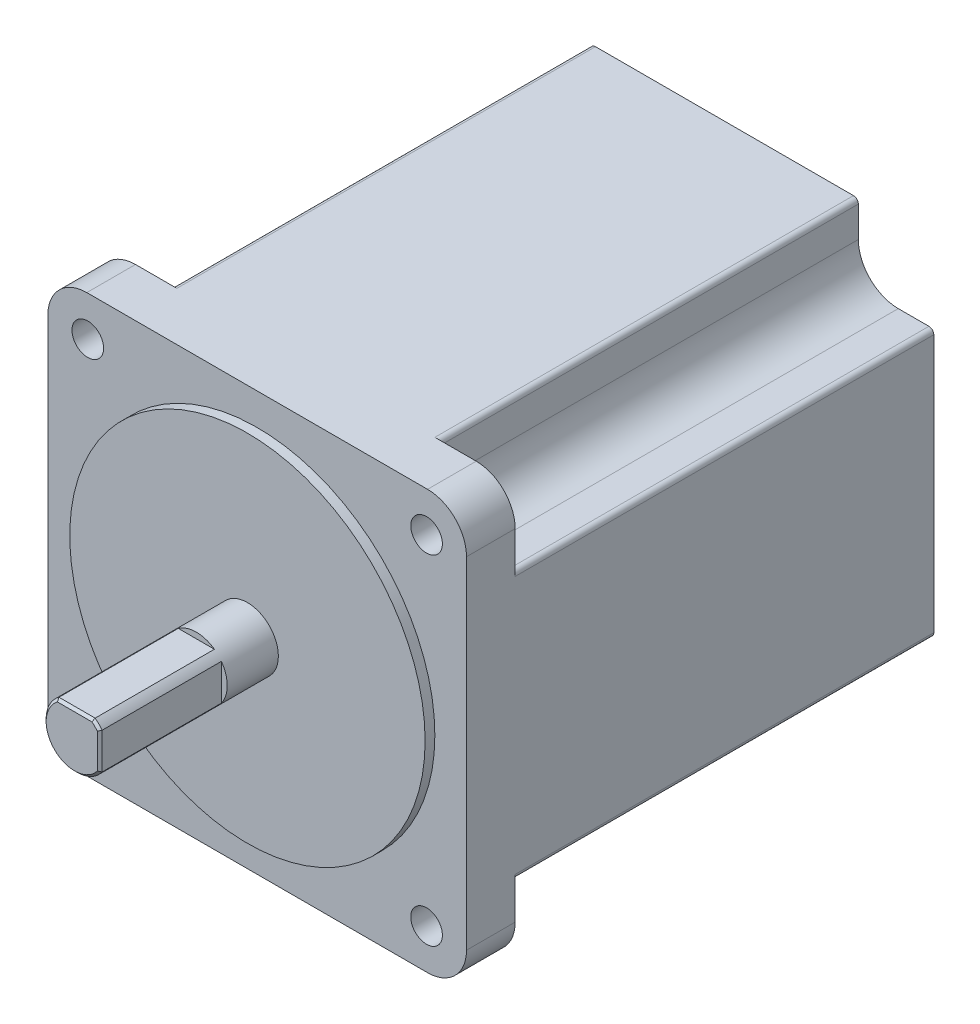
ISO-10303-21;
HEADER;
FILE_DESCRIPTION(('STEP AP214'),'2;1');
FILE_NAME('part.step','',(''),(''),'','','');
FILE_SCHEMA(('AUTOMOTIVE_DESIGN { 1 0 10303 214 1 1 1 1 }'));
ENDSEC;
DATA;
#1=APPLICATION_CONTEXT('core data for automotive mechanical design processes');
#2=APPLICATION_PROTOCOL_DEFINITION('international standard','automotive_design',2000,#1);
#3=PRODUCT_CONTEXT('',#1,'mechanical');
#4=PRODUCT('Part','Part','',(#3));
#5=PRODUCT_RELATED_PRODUCT_CATEGORY('part','',(#4));
#6=PRODUCT_DEFINITION_FORMATION('','',#4);
#7=PRODUCT_DEFINITION_CONTEXT('part definition',#1,'design');
#8=PRODUCT_DEFINITION('design','',#6,#7);
#9=PRODUCT_DEFINITION_SHAPE('','',#8);
#10=(LENGTH_UNIT() NAMED_UNIT(*) SI_UNIT(.MILLI.,.METRE.));
#11=(NAMED_UNIT(*) PLANE_ANGLE_UNIT() SI_UNIT($,.RADIAN.));
#12=(NAMED_UNIT(*) SI_UNIT($,.STERADIAN.) SOLID_ANGLE_UNIT());
#13=UNCERTAINTY_MEASURE_WITH_UNIT(LENGTH_MEASURE(1.E-05),#10,'distance_accuracy_value','');
#14=(GEOMETRIC_REPRESENTATION_CONTEXT(3) GLOBAL_UNCERTAINTY_ASSIGNED_CONTEXT((#13)) GLOBAL_UNIT_ASSIGNED_CONTEXT((#10,
#11,#12)) REPRESENTATION_CONTEXT('',''));
#15=CARTESIAN_POINT('',(0.,0.,0.));
#16=DIRECTION('',(0.,0.,1.));
#17=DIRECTION('',(1.,0.,0.));
#18=AXIS2_PLACEMENT_3D('',#15,#16,#17);
#19=CARTESIAN_POINT('',(35.,-35.,-98.));
#20=DIRECTION('',(0.,0.,1.));
#21=DIRECTION('',(1.,0.,0.));
#22=AXIS2_PLACEMENT_3D('',#19,#20,#21);
#23=CYLINDRICAL_SURFACE('',#22,8.);
#24=CARTESIAN_POINT('',(35.,-35.,-12.));
#25=DIRECTION('',(0.,0.,-1.));
#26=DIRECTION('',(-1.,0.,0.));
#27=AXIS2_PLACEMENT_3D('',#24,#25,#26);
#28=CIRCLE('',#27,8.);
#29=CARTESIAN_POINT('',(43.,-35.,-12.));
#30=VERTEX_POINT('',#29);
#31=CARTESIAN_POINT('',(34.9999999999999,-43.,-12.));
#32=VERTEX_POINT('',#31);
#33=EDGE_CURVE('E341',#30,#32,#28,.T.);
#34=ORIENTED_EDGE('',*,*,#33,.F.);
#35=DIRECTION('',(0.,0.,1.));
#36=VECTOR('',#35,1.);
#37=CARTESIAN_POINT('',(43.,-35.,-98.));
#38=LINE('',#37,#36);
#39=CARTESIAN_POINT('',(43.,-35.,-2.));
#40=VERTEX_POINT('',#39);
#41=EDGE_CURVE('E520',#30,#40,#38,.T.);
#42=ORIENTED_EDGE('',*,*,#41,.T.);
#43=CARTESIAN_POINT('',(35.,-35.,-2.));
#44=DIRECTION('',(0.,0.,-1.));
#45=DIRECTION('',(1.,0.,0.));
#46=AXIS2_PLACEMENT_3D('',#43,#44,#45);
#47=CIRCLE('',#46,8.);
#48=CARTESIAN_POINT('',(34.9999999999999,-43.,-2.));
#49=VERTEX_POINT('',#48);
#50=EDGE_CURVE('E510',#40,#49,#47,.T.);
#51=ORIENTED_EDGE('',*,*,#50,.T.);
#52=DIRECTION('',(0.,0.,1.));
#53=VECTOR('',#52,1.);
#54=CARTESIAN_POINT('',(34.9999999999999,-43.,-98.));
#55=LINE('',#54,#53);
#56=EDGE_CURVE('E556',#32,#49,#55,.T.);
#57=ORIENTED_EDGE('',*,*,#56,.F.);
#58=EDGE_LOOP('',(#34,#42,#51,#57));
#59=FACE_BOUND('',#58,.T.);
#60=ADVANCED_FACE('F35',(#59),#23,.T.);
#61=CARTESIAN_POINT('',(34.8,-34.8,-98.));
#62=DIRECTION('',(0.,0.,1.));
#63=DIRECTION('',(1.,0.,0.));
#64=AXIS2_PLACEMENT_3D('',#61,#62,#63);
#65=CYLINDRICAL_SURFACE('',#64,3.25);
#66=CARTESIAN_POINT('',(34.8,-34.8,-2.));
#67=DIRECTION('',(0.,0.,-1.));
#68=DIRECTION('',(-1.,0.,0.));
#69=AXIS2_PLACEMENT_3D('',#66,#67,#68);
#70=CIRCLE('',#69,3.25);
#71=CARTESIAN_POINT('',(31.55,-34.8,-2.));
#72=VERTEX_POINT('',#71);
#73=EDGE_CURVE('E498',#72,#72,#70,.T.);
#74=ORIENTED_EDGE('',*,*,#73,.F.);
#75=EDGE_LOOP('',(#74));
#76=FACE_BOUND('',#75,.T.);
#77=CARTESIAN_POINT('',(34.8,-34.8,-12.));
#78=DIRECTION('',(0.,0.,-1.));
#79=DIRECTION('',(-1.,0.,0.));
#80=AXIS2_PLACEMENT_3D('',#77,#78,#79);
#81=CIRCLE('',#80,3.25);
#82=CARTESIAN_POINT('',(31.55,-34.8,-12.));
#83=VERTEX_POINT('',#82);
#84=EDGE_CURVE('E330',#83,#83,#81,.T.);
#85=ORIENTED_EDGE('',*,*,#84,.T.);
#86=EDGE_LOOP('',(#85));
#87=FACE_BOUND('',#86,.T.);
#88=ADVANCED_FACE('F641',(#76,#87),#65,.F.);
#89=CARTESIAN_POINT('',(-35.,-35.,-98.));
#90=DIRECTION('',(0.,0.,1.));
#91=DIRECTION('',(1.,0.,0.));
#92=AXIS2_PLACEMENT_3D('',#89,#90,#91);
#93=CYLINDRICAL_SURFACE('',#92,8.);
#94=CARTESIAN_POINT('',(-35.,-35.,-12.));
#95=DIRECTION('',(0.,0.,-1.));
#96=DIRECTION('',(-1.,0.,0.));
#97=AXIS2_PLACEMENT_3D('',#94,#95,#96);
#98=CIRCLE('',#97,8.);
#99=CARTESIAN_POINT('',(-35.,-43.,-12.));
#100=VERTEX_POINT('',#99);
#101=CARTESIAN_POINT('',(-43.,-34.9999999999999,-12.));
#102=VERTEX_POINT('',#101);
#103=EDGE_CURVE('E391',#100,#102,#98,.T.);
#104=ORIENTED_EDGE('',*,*,#103,.F.);
#105=DIRECTION('',(0.,0.,1.));
#106=VECTOR('',#105,1.);
#107=CARTESIAN_POINT('',(-35.,-43.,-98.));
#108=LINE('',#107,#106);
#109=CARTESIAN_POINT('',(-35.,-43.,-2.));
#110=VERTEX_POINT('',#109);
#111=EDGE_CURVE('E554',#100,#110,#108,.T.);
#112=ORIENTED_EDGE('',*,*,#111,.T.);
#113=CARTESIAN_POINT('',(-35.,-35.,-2.));
#114=DIRECTION('',(0.,0.,-1.));
#115=DIRECTION('',(1.,0.,0.));
#116=AXIS2_PLACEMENT_3D('',#113,#114,#115);
#117=CIRCLE('',#116,8.);
#118=CARTESIAN_POINT('',(-43.,-34.9999999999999,-2.));
#119=VERTEX_POINT('',#118);
#120=EDGE_CURVE('E526',#110,#119,#117,.T.);
#121=ORIENTED_EDGE('',*,*,#120,.T.);
#122=DIRECTION('',(0.,0.,1.));
#123=VECTOR('',#122,1.);
#124=CARTESIAN_POINT('',(-43.,-34.9999999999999,-98.));
#125=LINE('',#124,#123);
#126=EDGE_CURVE('E552',#102,#119,#125,.T.);
#127=ORIENTED_EDGE('',*,*,#126,.F.);
#128=EDGE_LOOP('',(#104,#112,#121,#127));
#129=FACE_BOUND('',#128,.T.);
#130=ADVANCED_FACE('F647',(#129),#93,.T.);
#131=CARTESIAN_POINT('',(-34.8,-34.8,-98.));
#132=DIRECTION('',(0.,0.,1.));
#133=DIRECTION('',(1.,0.,0.));
#134=AXIS2_PLACEMENT_3D('',#131,#132,#133);
#135=CYLINDRICAL_SURFACE('',#134,3.25);
#136=CARTESIAN_POINT('',(-34.8,-34.8,-2.));
#137=DIRECTION('',(0.,0.,-1.));
#138=DIRECTION('',(-1.,0.,0.));
#139=AXIS2_PLACEMENT_3D('',#136,#137,#138);
#140=CIRCLE('',#139,3.25);
#141=CARTESIAN_POINT('',(-38.05,-34.8,-2.));
#142=VERTEX_POINT('',#141);
#143=EDGE_CURVE('E501',#142,#142,#140,.T.);
#144=ORIENTED_EDGE('',*,*,#143,.F.);
#145=EDGE_LOOP('',(#144));
#146=FACE_BOUND('',#145,.T.);
#147=CARTESIAN_POINT('',(-34.8,-34.8,-12.));
#148=DIRECTION('',(0.,0.,-1.));
#149=DIRECTION('',(-1.,0.,0.));
#150=AXIS2_PLACEMENT_3D('',#147,#148,#149);
#151=CIRCLE('',#150,3.25);
#152=CARTESIAN_POINT('',(-38.05,-34.8,-12.));
#153=VERTEX_POINT('',#152);
#154=EDGE_CURVE('E378',#153,#153,#151,.T.);
#155=ORIENTED_EDGE('',*,*,#154,.T.);
#156=EDGE_LOOP('',(#155));
#157=FACE_BOUND('',#156,.T.);
#158=ADVANCED_FACE('F807',(#146,#157),#135,.F.);
#159=CARTESIAN_POINT('',(35.,35.,-98.));
#160=DIRECTION('',(0.,0.,1.));
#161=DIRECTION('',(1.,0.,0.));
#162=AXIS2_PLACEMENT_3D('',#159,#160,#161);
#163=CYLINDRICAL_SURFACE('',#162,8.);
#164=CARTESIAN_POINT('',(35.,35.,-12.));
#165=DIRECTION('',(0.,0.,-1.));
#166=DIRECTION('',(-1.,0.,0.));
#167=AXIS2_PLACEMENT_3D('',#164,#165,#166);
#168=CIRCLE('',#167,8.);
#169=CARTESIAN_POINT('',(34.9999999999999,43.,-12.));
#170=VERTEX_POINT('',#169);
#171=CARTESIAN_POINT('',(43.,34.9999999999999,-12.));
#172=VERTEX_POINT('',#171);
#173=EDGE_CURVE('E441',#170,#172,#168,.T.);
#174=ORIENTED_EDGE('',*,*,#173,.F.);
#175=DIRECTION('',(0.,0.,1.));
#176=VECTOR('',#175,1.);
#177=CARTESIAN_POINT('',(34.9999999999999,43.,-98.));
#178=LINE('',#177,#176);
#179=CARTESIAN_POINT('',(34.9999999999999,43.,-2.));
#180=VERTEX_POINT('',#179);
#181=EDGE_CURVE('E546',#170,#180,#178,.T.);
#182=ORIENTED_EDGE('',*,*,#181,.T.);
#183=CARTESIAN_POINT('',(35.,35.,-2.));
#184=DIRECTION('',(0.,0.,-1.));
#185=DIRECTION('',(1.,0.,0.));
#186=AXIS2_PLACEMENT_3D('',#183,#184,#185);
#187=CIRCLE('',#186,8.);
#188=CARTESIAN_POINT('',(43.,34.9999999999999,-2.));
#189=VERTEX_POINT('',#188);
#190=EDGE_CURVE('E538',#180,#189,#187,.T.);
#191=ORIENTED_EDGE('',*,*,#190,.T.);
#192=DIRECTION('',(0.,0.,1.));
#193=VECTOR('',#192,1.);
#194=CARTESIAN_POINT('',(43.,34.9999999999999,-98.));
#195=LINE('',#194,#193);
#196=EDGE_CURVE('E544',#172,#189,#195,.T.);
#197=ORIENTED_EDGE('',*,*,#196,.F.);
#198=EDGE_LOOP('',(#174,#182,#191,#197));
#199=FACE_BOUND('',#198,.T.);
#200=ADVANCED_FACE('F810',(#199),#163,.T.);
#201=CARTESIAN_POINT('',(34.8,34.8,-98.));
#202=DIRECTION('',(0.,0.,1.));
#203=DIRECTION('',(1.,0.,0.));
#204=AXIS2_PLACEMENT_3D('',#201,#202,#203);
#205=CYLINDRICAL_SURFACE('',#204,3.25);
#206=CARTESIAN_POINT('',(34.8,34.8,-2.));
#207=DIRECTION('',(0.,0.,-1.));
#208=DIRECTION('',(-1.,0.,0.));
#209=AXIS2_PLACEMENT_3D('',#206,#207,#208);
#210=CIRCLE('',#209,3.25);
#211=CARTESIAN_POINT('',(31.55,34.8,-2.));
#212=VERTEX_POINT('',#211);
#213=EDGE_CURVE('E507',#212,#212,#210,.T.);
#214=ORIENTED_EDGE('',*,*,#213,.F.);
#215=EDGE_LOOP('',(#214));
#216=FACE_BOUND('',#215,.T.);
#217=CARTESIAN_POINT('',(34.8,34.8,-12.));
#218=DIRECTION('',(0.,0.,-1.));
#219=DIRECTION('',(-1.,0.,0.));
#220=AXIS2_PLACEMENT_3D('',#217,#218,#219);
#221=CIRCLE('',#220,3.25);
#222=CARTESIAN_POINT('',(31.55,34.8,-12.));
#223=VERTEX_POINT('',#222);
#224=EDGE_CURVE('E428',#223,#223,#221,.T.);
#225=ORIENTED_EDGE('',*,*,#224,.T.);
#226=EDGE_LOOP('',(#225));
#227=FACE_BOUND('',#226,.T.);
#228=ADVANCED_FACE('F682',(#216,#227),#205,.F.);
#229=CARTESIAN_POINT('',(0.,0.,0.));
#230=DIRECTION('',(0.,0.,1.));
#231=DIRECTION('',(1.,0.,0.));
#232=AXIS2_PLACEMENT_3D('',#229,#230,#231);
#233=PLANE('',#232);
#234=CARTESIAN_POINT('',(0.,0.,0.));
#235=DIRECTION('',(0.,0.,1.));
#236=DIRECTION('',(1.,0.,0.));
#237=AXIS2_PLACEMENT_3D('',#234,#235,#236);
#238=CIRCLE('',#237,36.5);
#239=CARTESIAN_POINT('',(36.5,0.,0.));
#240=VERTEX_POINT('',#239);
#241=EDGE_CURVE('E579',#240,#240,#238,.T.);
#242=ORIENTED_EDGE('',*,*,#241,.T.);
#243=EDGE_LOOP('',(#242));
#244=FACE_BOUND('',#243,.T.);
#245=CARTESIAN_POINT('',(0.,0.,0.));
#246=DIRECTION('',(0.,0.,1.));
#247=DIRECTION('',(1.,0.,0.));
#248=AXIS2_PLACEMENT_3D('',#245,#246,#247);
#249=CIRCLE('',#248,6.35);
#250=CARTESIAN_POINT('',(6.35,0.,0.));
#251=VERTEX_POINT('',#250);
#252=EDGE_CURVE('E576',#251,#251,#249,.T.);
#253=ORIENTED_EDGE('',*,*,#252,.F.);
#254=EDGE_LOOP('',(#253));
#255=FACE_BOUND('',#254,.T.);
#256=ADVANCED_FACE('F680',(#244,#255),#233,.T.);
#257=CARTESIAN_POINT('',(0.,0.,-2.));
#258=DIRECTION('',(0.,0.,1.));
#259=DIRECTION('',(1.,0.,0.));
#260=AXIS2_PLACEMENT_3D('',#257,#258,#259);
#261=CYLINDRICAL_SURFACE('',#260,36.5);
#262=CARTESIAN_POINT('',(0.,0.,-2.));
#263=DIRECTION('',(0.,0.,1.));
#264=DIRECTION('',(1.,0.,0.));
#265=AXIS2_PLACEMENT_3D('',#262,#263,#264);
#266=CIRCLE('',#265,36.5);
#267=CARTESIAN_POINT('',(36.5,0.,-2.));
#268=VERTEX_POINT('',#267);
#269=EDGE_CURVE('E558',#268,#268,#266,.F.);
#270=ORIENTED_EDGE('',*,*,#269,.F.);
#271=EDGE_LOOP('',(#270));
#272=FACE_BOUND('',#271,.T.);
#273=ORIENTED_EDGE('',*,*,#241,.F.);
#274=EDGE_LOOP('',(#273));
#275=FACE_BOUND('',#274,.T.);
#276=ADVANCED_FACE('F678',(#272,#275),#261,.T.);
#277=CARTESIAN_POINT('',(0.,0.,35.5));
#278=DIRECTION('',(0.,0.,-1.));
#279=DIRECTION('',(-1.,0.,0.));
#280=AXIS2_PLACEMENT_3D('',#277,#278,#279);
#281=CYLINDRICAL_SURFACE('',#280,6.35);
#282=DIRECTION('',(0.,0.,-1.));
#283=VECTOR('',#282,1.);
#284=CARTESIAN_POINT('',(5.15,-3.71483512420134,35.5));
#285=LINE('',#284,#283);
#286=CARTESIAN_POINT('',(5.15,-3.71483512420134,10.5));
#287=VERTEX_POINT('',#286);
#288=CARTESIAN_POINT('',(5.15,-3.71483512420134,35.));
#289=VERTEX_POINT('',#288);
#290=EDGE_CURVE('E564',#287,#289,#285,.F.);
#291=ORIENTED_EDGE('',*,*,#290,.T.);
#292=CARTESIAN_POINT('',(0.,0.,35.));
#293=DIRECTION('',(0.,0.,1.));
#294=DIRECTION('',(1.,0.,0.));
#295=AXIS2_PLACEMENT_3D('',#292,#293,#294);
#296=CIRCLE('',#295,6.35);
#297=CARTESIAN_POINT('',(-3.71483512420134,5.15,35.));
#298=VERTEX_POINT('',#297);
#299=EDGE_CURVE('E607',#289,#298,#296,.F.);
#300=ORIENTED_EDGE('',*,*,#299,.T.);
#301=DIRECTION('',(0.,0.,-1.));
#302=VECTOR('',#301,1.);
#303=CARTESIAN_POINT('',(-3.71483512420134,5.15,35.5));
#304=LINE('',#303,#302);
#305=CARTESIAN_POINT('',(-3.71483512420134,5.15,10.5));
#306=VERTEX_POINT('',#305);
#307=EDGE_CURVE('E574',#298,#306,#304,.T.);
#308=ORIENTED_EDGE('',*,*,#307,.T.);
#309=CARTESIAN_POINT('',(0.,0.,10.5));
#310=DIRECTION('',(0.,0.,1.));
#311=DIRECTION('',(1.,0.,0.));
#312=AXIS2_PLACEMENT_3D('',#309,#310,#311);
#313=CIRCLE('',#312,6.35);
#314=CARTESIAN_POINT('',(3.71483512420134,5.15,10.5));
#315=VERTEX_POINT('',#314);
#316=EDGE_CURVE('E582',#315,#306,#313,.T.);
#317=ORIENTED_EDGE('',*,*,#316,.F.);
#318=DIRECTION('',(0.,0.,-1.));
#319=VECTOR('',#318,1.);
#320=CARTESIAN_POINT('',(3.71483512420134,5.15,35.5));
#321=LINE('',#320,#319);
#322=CARTESIAN_POINT('',(3.71483512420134,5.15,35.));
#323=VERTEX_POINT('',#322);
#324=EDGE_CURVE('E572',#315,#323,#321,.F.);
#325=ORIENTED_EDGE('',*,*,#324,.T.);
#326=CARTESIAN_POINT('',(0.,0.,35.));
#327=DIRECTION('',(0.,0.,1.));
#328=DIRECTION('',(1.,0.,0.));
#329=AXIS2_PLACEMENT_3D('',#326,#327,#328);
#330=CIRCLE('',#329,6.35);
#331=CARTESIAN_POINT('',(5.15,3.71483512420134,35.));
#332=VERTEX_POINT('',#331);
#333=EDGE_CURVE('E605',#323,#332,#330,.F.);
#334=ORIENTED_EDGE('',*,*,#333,.T.);
#335=DIRECTION('',(0.,0.,-1.));
#336=VECTOR('',#335,1.);
#337=CARTESIAN_POINT('',(5.15,3.71483512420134,35.5));
#338=LINE('',#337,#336);
#339=CARTESIAN_POINT('',(5.15,3.71483512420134,10.5));
#340=VERTEX_POINT('',#339);
#341=EDGE_CURVE('E567',#332,#340,#338,.T.);
#342=ORIENTED_EDGE('',*,*,#341,.T.);
#343=CARTESIAN_POINT('',(0.,0.,10.5));
#344=DIRECTION('',(0.,0.,1.));
#345=DIRECTION('',(1.,0.,0.));
#346=AXIS2_PLACEMENT_3D('',#343,#344,#345);
#347=CIRCLE('',#346,6.35);
#348=EDGE_CURVE('E585',#287,#340,#347,.T.);
#349=ORIENTED_EDGE('',*,*,#348,.F.);
#350=EDGE_LOOP('',(#291,#300,#308,#317,#325,#334,#342,#349));
#351=FACE_BOUND('',#350,.T.);
#352=ORIENTED_EDGE('',*,*,#252,.T.);
#353=EDGE_LOOP('',(#352));
#354=FACE_BOUND('',#353,.T.);
#355=ADVANCED_FACE('F674',(#351,#354),#281,.T.);
#356=CARTESIAN_POINT('',(0.,0.,35.5));
#357=DIRECTION('',(0.,0.,1.));
#358=DIRECTION('',(1.,0.,0.));
#359=AXIS2_PLACEMENT_3D('',#356,#357,#358);
#360=PLANE('',#359);
#361=DIRECTION('',(-1.,0.,0.));
#362=VECTOR('',#361,1.);
#363=CARTESIAN_POINT('',(-3.71483512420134,4.65,35.5));
#364=LINE('',#363,#362);
#365=CARTESIAN_POINT('',(3.54964786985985,4.64999999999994,35.5));
#366=VERTEX_POINT('',#365);
#367=CARTESIAN_POINT('',(-3.54964786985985,4.65,35.5));
#368=VERTEX_POINT('',#367);
#369=EDGE_CURVE('E600',#366,#368,#364,.T.);
#370=ORIENTED_EDGE('',*,*,#369,.T.);
#371=CARTESIAN_POINT('',(0.,0.,35.5));
#372=DIRECTION('',(0.,0.,1.));
#373=DIRECTION('',(1.,0.,0.));
#374=AXIS2_PLACEMENT_3D('',#371,#372,#373);
#375=CIRCLE('',#374,5.85);
#376=CARTESIAN_POINT('',(4.65,-3.54964786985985,35.5));
#377=VERTEX_POINT('',#376);
#378=EDGE_CURVE('E602',#368,#377,#375,.T.);
#379=ORIENTED_EDGE('',*,*,#378,.T.);
#380=DIRECTION('',(0.,1.,0.));
#381=VECTOR('',#380,1.);
#382=CARTESIAN_POINT('',(4.65,3.71483512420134,35.5));
#383=LINE('',#382,#381);
#384=CARTESIAN_POINT('',(4.65,3.54964786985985,35.5));
#385=VERTEX_POINT('',#384);
#386=EDGE_CURVE('E588',#377,#385,#383,.T.);
#387=ORIENTED_EDGE('',*,*,#386,.T.);
#388=CARTESIAN_POINT('',(0.,0.,35.5));
#389=DIRECTION('',(0.,0.,1.));
#390=DIRECTION('',(1.,0.,0.));
#391=AXIS2_PLACEMENT_3D('',#388,#389,#390);
#392=CIRCLE('',#391,5.85);
#393=EDGE_CURVE('E598',#385,#366,#392,.T.);
#394=ORIENTED_EDGE('',*,*,#393,.T.);
#395=EDGE_LOOP('',(#370,#379,#387,#394));
#396=FACE_BOUND('',#395,.T.);
#397=ADVANCED_FACE('F668',(#396),#360,.T.);
#398=CARTESIAN_POINT('',(0.,0.,10.5));
#399=DIRECTION('',(0.,0.,1.));
#400=DIRECTION('',(1.,0.,0.));
#401=AXIS2_PLACEMENT_3D('',#398,#399,#400);
#402=PLANE('',#401);
#403=ORIENTED_EDGE('',*,*,#316,.T.);
#404=DIRECTION('',(1.,0.,0.));
#405=VECTOR('',#404,1.);
#406=CARTESIAN_POINT('',(-5.401405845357,5.15,10.5));
#407=LINE('',#406,#405);
#408=EDGE_CURVE('E569',#306,#315,#407,.T.);
#409=ORIENTED_EDGE('',*,*,#408,.T.);
#410=EDGE_LOOP('',(#403,#409));
#411=FACE_BOUND('',#410,.T.);
#412=ADVANCED_FACE('F665',(#411),#402,.T.);
#413=CARTESIAN_POINT('',(0.,5.15,10.5));
#414=DIRECTION('',(0.,-1.,0.));
#415=DIRECTION('',(0.,0.,-1.));
#416=AXIS2_PLACEMENT_3D('',#413,#414,#415);
#417=PLANE('',#416);
#418=ORIENTED_EDGE('',*,*,#307,.F.);
#419=DIRECTION('',(1.,0.,0.));
#420=VECTOR('',#419,1.);
#421=CARTESIAN_POINT('',(3.71483512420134,5.15,35.));
#422=LINE('',#421,#420);
#423=EDGE_CURVE('E48',#298,#323,#422,.T.);
#424=ORIENTED_EDGE('',*,*,#423,.T.);
#425=ORIENTED_EDGE('',*,*,#324,.F.);
#426=ORIENTED_EDGE('',*,*,#408,.F.);
#427=EDGE_LOOP('',(#418,#424,#425,#426));
#428=FACE_BOUND('',#427,.T.);
#429=ADVANCED_FACE('F659',(#428),#417,.F.);
#430=CARTESIAN_POINT('',(0.,0.,10.5));
#431=DIRECTION('',(0.,0.,1.));
#432=DIRECTION('',(1.,0.,0.));
#433=AXIS2_PLACEMENT_3D('',#430,#431,#432);
#434=PLANE('',#433);
#435=ORIENTED_EDGE('',*,*,#348,.T.);
#436=DIRECTION('',(0.,-1.,0.));
#437=VECTOR('',#436,1.);
#438=CARTESIAN_POINT('',(5.15,4.40641003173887,10.5));
#439=LINE('',#438,#437);
#440=EDGE_CURVE('E561',#340,#287,#439,.T.);
#441=ORIENTED_EDGE('',*,*,#440,.T.);
#442=EDGE_LOOP('',(#435,#441));
#443=FACE_BOUND('',#442,.T.);
#444=ADVANCED_FACE('F655',(#443),#434,.T.);
#445=CARTESIAN_POINT('',(5.15,0.,10.5));
#446=DIRECTION('',(-1.,0.,0.));
#447=DIRECTION('',(0.,0.,1.));
#448=AXIS2_PLACEMENT_3D('',#445,#446,#447);
#449=PLANE('',#448);
#450=ORIENTED_EDGE('',*,*,#341,.F.);
#451=DIRECTION('',(0.,-1.,0.));
#452=VECTOR('',#451,1.);
#453=CARTESIAN_POINT('',(5.15,-3.71483512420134,35.));
#454=LINE('',#453,#452);
#455=EDGE_CURVE('E11',#332,#289,#454,.T.);
#456=ORIENTED_EDGE('',*,*,#455,.T.);
#457=ORIENTED_EDGE('',*,*,#290,.F.);
#458=ORIENTED_EDGE('',*,*,#440,.F.);
#459=EDGE_LOOP('',(#450,#456,#457,#458));
#460=FACE_BOUND('',#459,.T.);
#461=ADVANCED_FACE('F658',(#460),#449,.F.);
#462=CARTESIAN_POINT('',(35.,-35.,-98.));
#463=DIRECTION('',(0.,0.,1.));
#464=DIRECTION('',(1.,0.,0.));
#465=AXIS2_PLACEMENT_3D('',#462,#463,#464);
#466=PLANE('',#465);
#467=DIRECTION('',(0.,1.,0.));
#468=VECTOR('',#467,1.);
#469=CARTESIAN_POINT('',(27.5,-42.,-98.));
#470=LINE('',#469,#468);
#471=CARTESIAN_POINT('',(27.5,-42.,-98.));
#472=VERTEX_POINT('',#471);
#473=CARTESIAN_POINT('',(27.5,-35.7000000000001,-98.));
#474=VERTEX_POINT('',#473);
#475=EDGE_CURVE('E310',#472,#474,#470,.T.);
#476=ORIENTED_EDGE('',*,*,#475,.F.);
#477=CARTESIAN_POINT('',(26.5,-42.,-98.));
#478=DIRECTION('',(0.,0.,1.));
#479=DIRECTION('',(1.,0.,0.));
#480=AXIS2_PLACEMENT_3D('',#477,#478,#479);
#481=CIRCLE('',#480,0.999999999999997);
#482=CARTESIAN_POINT('',(26.5,-43.,-98.));
#483=VERTEX_POINT('',#482);
#484=EDGE_CURVE('E313',#483,#472,#481,.T.);
#485=ORIENTED_EDGE('',*,*,#484,.F.);
#486=DIRECTION('',(-1.,0.,0.));
#487=VECTOR('',#486,1.);
#488=CARTESIAN_POINT('',(-35.,-43.,-98.));
#489=LINE('',#488,#487);
#490=CARTESIAN_POINT('',(-26.5,-43.,-98.));
#491=VERTEX_POINT('',#490);
#492=EDGE_CURVE('E511',#483,#491,#489,.T.);
#493=ORIENTED_EDGE('',*,*,#492,.T.);
#494=CARTESIAN_POINT('',(-26.5,-42.,-98.));
#495=DIRECTION('',(0.,0.,1.));
#496=DIRECTION('',(-1.,0.,0.));
#497=AXIS2_PLACEMENT_3D('',#494,#495,#496);
#498=CIRCLE('',#497,1.);
#499=CARTESIAN_POINT('',(-27.5,-42.,-98.));
#500=VERTEX_POINT('',#499);
#501=EDGE_CURVE('E345',#500,#491,#498,.T.);
#502=ORIENTED_EDGE('',*,*,#501,.F.);
#503=DIRECTION('',(0.,-1.,0.));
#504=VECTOR('',#503,1.);
#505=CARTESIAN_POINT('',(-27.5,-42.,-98.));
#506=LINE('',#505,#504);
#507=CARTESIAN_POINT('',(-27.5,-35.7000000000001,-98.));
#508=VERTEX_POINT('',#507);
#509=EDGE_CURVE('E350',#508,#500,#506,.T.);
#510=ORIENTED_EDGE('',*,*,#509,.F.);
#511=CARTESIAN_POINT('',(-35.7,-35.7,-98.));
#512=DIRECTION('',(0.,0.,-1.));
#513=DIRECTION('',(1.,0.,0.));
#514=AXIS2_PLACEMENT_3D('',#511,#512,#513);
#515=CIRCLE('',#514,8.19999999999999);
#516=CARTESIAN_POINT('',(-35.7,-27.5,-98.));
#517=VERTEX_POINT('',#516);
#518=EDGE_CURVE('E371',#517,#508,#515,.T.);
#519=ORIENTED_EDGE('',*,*,#518,.F.);
#520=DIRECTION('',(1.,0.,0.));
#521=VECTOR('',#520,1.);
#522=CARTESIAN_POINT('',(-35.7,-27.5,-98.));
#523=LINE('',#522,#521);
#524=CARTESIAN_POINT('',(-42.,-27.5,-98.));
#525=VERTEX_POINT('',#524);
#526=EDGE_CURVE('E368',#525,#517,#523,.T.);
#527=ORIENTED_EDGE('',*,*,#526,.F.);
#528=CARTESIAN_POINT('',(-42.,-26.5,-98.));
#529=DIRECTION('',(0.,0.,1.));
#530=DIRECTION('',(-1.,0.,0.));
#531=AXIS2_PLACEMENT_3D('',#528,#529,#530);
#532=CIRCLE('',#531,1.);
#533=CARTESIAN_POINT('',(-43.,-26.5,-98.));
#534=VERTEX_POINT('',#533);
#535=EDGE_CURVE('E365',#534,#525,#532,.T.);
#536=ORIENTED_EDGE('',*,*,#535,.F.);
#537=DIRECTION('',(0.,1.,0.));
#538=VECTOR('',#537,1.);
#539=CARTESIAN_POINT('',(-43.,34.9999999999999,-98.));
#540=LINE('',#539,#538);
#541=CARTESIAN_POINT('',(-43.,26.5,-98.));
#542=VERTEX_POINT('',#541);
#543=EDGE_CURVE('E513',#534,#542,#540,.T.);
#544=ORIENTED_EDGE('',*,*,#543,.T.);
#545=CARTESIAN_POINT('',(-42.,26.5,-98.));
#546=DIRECTION('',(0.,0.,1.));
#547=DIRECTION('',(1.,0.,0.));
#548=AXIS2_PLACEMENT_3D('',#545,#546,#547);
#549=CIRCLE('',#548,1.);
#550=CARTESIAN_POINT('',(-42.,27.5,-98.));
#551=VERTEX_POINT('',#550);
#552=EDGE_CURVE('E450',#551,#542,#549,.T.);
#553=ORIENTED_EDGE('',*,*,#552,.F.);
#554=DIRECTION('',(-1.,0.,0.));
#555=VECTOR('',#554,1.);
#556=CARTESIAN_POINT('',(-35.7000000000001,27.5,-98.));
#557=LINE('',#556,#555);
#558=CARTESIAN_POINT('',(-35.7000000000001,27.5,-98.));
#559=VERTEX_POINT('',#558);
#560=EDGE_CURVE('E471',#559,#551,#557,.T.);
#561=ORIENTED_EDGE('',*,*,#560,.F.);
#562=CARTESIAN_POINT('',(-35.7,35.7,-98.));
#563=DIRECTION('',(0.,0.,-1.));
#564=DIRECTION('',(-1.,0.,0.));
#565=AXIS2_PLACEMENT_3D('',#562,#563,#564);
#566=CIRCLE('',#565,8.2);
#567=CARTESIAN_POINT('',(-27.5,35.7000000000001,-98.));
#568=VERTEX_POINT('',#567);
#569=EDGE_CURVE('E468',#568,#559,#566,.T.);
#570=ORIENTED_EDGE('',*,*,#569,.F.);
#571=DIRECTION('',(0.,-1.,0.));
#572=VECTOR('',#571,1.);
#573=CARTESIAN_POINT('',(-27.5,42.,-98.));
#574=LINE('',#573,#572);
#575=CARTESIAN_POINT('',(-27.5,42.,-98.));
#576=VERTEX_POINT('',#575);
#577=EDGE_CURVE('E465',#576,#568,#574,.T.);
#578=ORIENTED_EDGE('',*,*,#577,.F.);
#579=CARTESIAN_POINT('',(-26.5,42.,-98.));
#580=DIRECTION('',(0.,0.,1.));
#581=DIRECTION('',(1.,0.,0.));
#582=AXIS2_PLACEMENT_3D('',#579,#580,#581);
#583=CIRCLE('',#582,1.);
#584=CARTESIAN_POINT('',(-26.5,43.,-98.));
#585=VERTEX_POINT('',#584);
#586=EDGE_CURVE('E445',#585,#576,#583,.T.);
#587=ORIENTED_EDGE('',*,*,#586,.F.);
#588=DIRECTION('',(1.,0.,0.));
#589=VECTOR('',#588,1.);
#590=CARTESIAN_POINT('',(0.,43.,-98.));
#591=LINE('',#590,#589);
#592=CARTESIAN_POINT('',(26.5,43.,-98.));
#593=VERTEX_POINT('',#592);
#594=EDGE_CURVE('E516',#585,#593,#591,.T.);
#595=ORIENTED_EDGE('',*,*,#594,.T.);
#596=CARTESIAN_POINT('',(26.5,42.,-98.));
#597=DIRECTION('',(0.,0.,1.));
#598=DIRECTION('',(-1.,0.,0.));
#599=AXIS2_PLACEMENT_3D('',#596,#597,#598);
#600=CIRCLE('',#599,0.999999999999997);
#601=CARTESIAN_POINT('',(27.5,42.,-98.));
#602=VERTEX_POINT('',#601);
#603=EDGE_CURVE('E395',#602,#593,#600,.T.);
#604=ORIENTED_EDGE('',*,*,#603,.F.);
#605=DIRECTION('',(0.,1.,0.));
#606=VECTOR('',#605,1.);
#607=CARTESIAN_POINT('',(27.5,42.,-98.));
#608=LINE('',#607,#606);
#609=CARTESIAN_POINT('',(27.5,35.7000000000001,-98.));
#610=VERTEX_POINT('',#609);
#611=EDGE_CURVE('E400',#610,#602,#608,.T.);
#612=ORIENTED_EDGE('',*,*,#611,.F.);
#613=CARTESIAN_POINT('',(35.7,35.7,-98.));
#614=DIRECTION('',(0.,0.,-1.));
#615=DIRECTION('',(1.,0.,0.));
#616=AXIS2_PLACEMENT_3D('',#613,#614,#615);
#617=CIRCLE('',#616,8.2);
#618=CARTESIAN_POINT('',(35.7,27.5,-98.));
#619=VERTEX_POINT('',#618);
#620=EDGE_CURVE('E421',#619,#610,#617,.T.);
#621=ORIENTED_EDGE('',*,*,#620,.F.);
#622=DIRECTION('',(-1.,0.,0.));
#623=VECTOR('',#622,1.);
#624=CARTESIAN_POINT('',(35.7,27.5,-98.));
#625=LINE('',#624,#623);
#626=CARTESIAN_POINT('',(42.,27.5,-98.));
#627=VERTEX_POINT('',#626);
#628=EDGE_CURVE('E418',#627,#619,#625,.T.);
#629=ORIENTED_EDGE('',*,*,#628,.F.);
#630=CARTESIAN_POINT('',(42.,26.5,-98.));
#631=DIRECTION('',(0.,0.,1.));
#632=DIRECTION('',(-1.,0.,0.));
#633=AXIS2_PLACEMENT_3D('',#630,#631,#632);
#634=CIRCLE('',#633,1.);
#635=CARTESIAN_POINT('',(43.,26.5,-98.));
#636=VERTEX_POINT('',#635);
#637=EDGE_CURVE('E415',#636,#627,#634,.T.);
#638=ORIENTED_EDGE('',*,*,#637,.F.);
#639=DIRECTION('',(0.,-1.,0.));
#640=VECTOR('',#639,1.);
#641=CARTESIAN_POINT('',(43.,-35.,-98.));
#642=LINE('',#641,#640);
#643=CARTESIAN_POINT('',(43.,-26.5,-98.));
#644=VERTEX_POINT('',#643);
#645=EDGE_CURVE('E518',#636,#644,#642,.T.);
#646=ORIENTED_EDGE('',*,*,#645,.T.);
#647=CARTESIAN_POINT('',(42.,-26.5,-98.));
#648=DIRECTION('',(0.,0.,1.));
#649=DIRECTION('',(1.,0.,0.));
#650=AXIS2_PLACEMENT_3D('',#647,#648,#649);
#651=CIRCLE('',#650,1.);
#652=CARTESIAN_POINT('',(42.,-27.5,-98.));
#653=VERTEX_POINT('',#652);
#654=EDGE_CURVE('E323',#653,#644,#651,.T.);
#655=ORIENTED_EDGE('',*,*,#654,.F.);
#656=DIRECTION('',(1.,0.,0.));
#657=VECTOR('',#656,1.);
#658=CARTESIAN_POINT('',(35.7,-27.5,-98.));
#659=LINE('',#658,#657);
#660=CARTESIAN_POINT('',(35.7,-27.5,-98.));
#661=VERTEX_POINT('',#660);
#662=EDGE_CURVE('E321',#661,#653,#659,.T.);
#663=ORIENTED_EDGE('',*,*,#662,.F.);
#664=CARTESIAN_POINT('',(35.7,-35.7,-98.));
#665=DIRECTION('',(0.,0.,-1.));
#666=DIRECTION('',(-1.,0.,0.));
#667=AXIS2_PLACEMENT_3D('',#664,#665,#666);
#668=CIRCLE('',#667,8.19999999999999);
#669=EDGE_CURVE('E293',#474,#661,#668,.T.);
#670=ORIENTED_EDGE('',*,*,#669,.F.);
#671=EDGE_LOOP('',(#476,#485,#493,#502,#510,#519,#527,#536,#544,#553,#561,#570,#578,#587,#595,
#604,#612,#621,#629,#638,#646,#655,#663,#670));
#672=FACE_BOUND('',#671,.T.);
#673=ADVANCED_FACE('F663',(#672),#466,.F.);
#674=CARTESIAN_POINT('',(35.,-35.,-2.));
#675=DIRECTION('',(0.,0.,1.));
#676=DIRECTION('',(1.,0.,0.));
#677=AXIS2_PLACEMENT_3D('',#674,#675,#676);
#678=PLANE('',#677);
#679=ORIENTED_EDGE('',*,*,#269,.T.);
#680=EDGE_LOOP('',(#679));
#681=FACE_BOUND('',#680,.T.);
#682=ORIENTED_EDGE('',*,*,#143,.T.);
#683=EDGE_LOOP('',(#682));
#684=FACE_BOUND('',#683,.T.);
#685=ORIENTED_EDGE('',*,*,#213,.T.);
#686=EDGE_LOOP('',(#685));
#687=FACE_BOUND('',#686,.T.);
#688=ORIENTED_EDGE('',*,*,#50,.F.);
#689=DIRECTION('',(0.,-1.,0.));
#690=VECTOR('',#689,1.);
#691=CARTESIAN_POINT('',(43.,-35.,-2.));
#692=LINE('',#691,#690);
#693=EDGE_CURVE('E514',#189,#40,#692,.T.);
#694=ORIENTED_EDGE('',*,*,#693,.F.);
#695=ORIENTED_EDGE('',*,*,#190,.F.);
#696=DIRECTION('',(1.,0.,0.));
#697=VECTOR('',#696,1.);
#698=CARTESIAN_POINT('',(34.9999999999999,43.,-2.));
#699=LINE('',#698,#697);
#700=CARTESIAN_POINT('',(-34.9999999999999,43.,-2.));
#701=VERTEX_POINT('',#700);
#702=EDGE_CURVE('E535',#701,#180,#699,.T.);
#703=ORIENTED_EDGE('',*,*,#702,.F.);
#704=CARTESIAN_POINT('',(-35.,35.,-2.));
#705=DIRECTION('',(0.,0.,-1.));
#706=DIRECTION('',(1.,0.,0.));
#707=AXIS2_PLACEMENT_3D('',#704,#705,#706);
#708=CIRCLE('',#707,8.);
#709=CARTESIAN_POINT('',(-43.,34.9999999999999,-2.));
#710=VERTEX_POINT('',#709);
#711=EDGE_CURVE('E532',#710,#701,#708,.T.);
#712=ORIENTED_EDGE('',*,*,#711,.F.);
#713=DIRECTION('',(0.,1.,0.));
#714=VECTOR('',#713,1.);
#715=CARTESIAN_POINT('',(-43.,34.9999999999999,-2.));
#716=LINE('',#715,#714);
#717=EDGE_CURVE('E529',#119,#710,#716,.T.);
#718=ORIENTED_EDGE('',*,*,#717,.F.);
#719=ORIENTED_EDGE('',*,*,#120,.F.);
#720=DIRECTION('',(-1.,0.,0.));
#721=VECTOR('',#720,1.);
#722=CARTESIAN_POINT('',(-35.,-43.,-2.));
#723=LINE('',#722,#721);
#724=EDGE_CURVE('E523',#49,#110,#723,.T.);
#725=ORIENTED_EDGE('',*,*,#724,.F.);
#726=EDGE_LOOP('',(#688,#694,#695,#703,#712,#718,#719,#725));
#727=FACE_BOUND('',#726,.T.);
#728=CARTESIAN_POINT('',(-34.8,34.8,-2.));
#729=DIRECTION('',(0.,0.,-1.));
#730=DIRECTION('',(-1.,0.,0.));
#731=AXIS2_PLACEMENT_3D('',#728,#729,#730);
#732=CIRCLE('',#731,3.25);
#733=CARTESIAN_POINT('',(-38.05,34.8,-2.));
#734=VERTEX_POINT('',#733);
#735=EDGE_CURVE('E504',#734,#734,#732,.T.);
#736=ORIENTED_EDGE('',*,*,#735,.T.);
#737=EDGE_LOOP('',(#736));
#738=FACE_BOUND('',#737,.T.);
#739=ORIENTED_EDGE('',*,*,#73,.T.);
#740=EDGE_LOOP('',(#739));
#741=FACE_BOUND('',#740,.T.);
#742=ADVANCED_FACE('F695',(#681,#684,#687,#727,#738,#741),#678,.T.);
#743=CARTESIAN_POINT('',(-35.,-43.,-98.));
#744=DIRECTION('',(0.,1.,0.));
#745=DIRECTION('',(-1.,0.,0.));
#746=AXIS2_PLACEMENT_3D('',#743,#744,#745);
#747=PLANE('',#746);
#748=DIRECTION('',(0.,0.,-1.));
#749=VECTOR('',#748,1.);
#750=CARTESIAN_POINT('',(-26.5,-43.,-12.));
#751=LINE('',#750,#749);
#752=CARTESIAN_POINT('',(-26.5,-43.,-12.));
#753=VERTEX_POINT('',#752);
#754=EDGE_CURVE('E362',#753,#491,#751,.T.);
#755=ORIENTED_EDGE('',*,*,#754,.T.);
#756=ORIENTED_EDGE('',*,*,#492,.F.);
#757=DIRECTION('',(0.,0.,-1.));
#758=VECTOR('',#757,1.);
#759=CARTESIAN_POINT('',(26.5,-43.,-12.));
#760=LINE('',#759,#758);
#761=CARTESIAN_POINT('',(26.5,-43.,-12.));
#762=VERTEX_POINT('',#761);
#763=EDGE_CURVE('E333',#762,#483,#760,.T.);
#764=ORIENTED_EDGE('',*,*,#763,.F.);
#765=DIRECTION('',(-1.,0.,0.));
#766=VECTOR('',#765,1.);
#767=CARTESIAN_POINT('',(-35.,-43.,-12.));
#768=LINE('',#767,#766);
#769=EDGE_CURVE('E343',#32,#762,#768,.T.);
#770=ORIENTED_EDGE('',*,*,#769,.F.);
#771=ORIENTED_EDGE('',*,*,#56,.T.);
#772=ORIENTED_EDGE('',*,*,#724,.T.);
#773=ORIENTED_EDGE('',*,*,#111,.F.);
#774=DIRECTION('',(-1.,0.,0.));
#775=VECTOR('',#774,1.);
#776=CARTESIAN_POINT('',(-35.,-43.,-12.));
#777=LINE('',#776,#775);
#778=EDGE_CURVE('E393',#753,#100,#777,.T.);
#779=ORIENTED_EDGE('',*,*,#778,.F.);
#780=EDGE_LOOP('',(#755,#756,#764,#770,#771,#772,#773,#779));
#781=FACE_BOUND('',#780,.T.);
#782=ADVANCED_FACE('F653',(#781),#747,.F.);
#783=CARTESIAN_POINT('',(-43.,34.9999999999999,-98.));
#784=DIRECTION('',(1.,0.,0.));
#785=DIRECTION('',(0.,1.,0.));
#786=AXIS2_PLACEMENT_3D('',#783,#784,#785);
#787=PLANE('',#786);
#788=DIRECTION('',(0.,0.,-1.));
#789=VECTOR('',#788,1.);
#790=CARTESIAN_POINT('',(-43.,26.5,-12.));
#791=LINE('',#790,#789);
#792=CARTESIAN_POINT('',(-43.,26.5,-12.));
#793=VERTEX_POINT('',#792);
#794=EDGE_CURVE('E476',#793,#542,#791,.T.);
#795=ORIENTED_EDGE('',*,*,#794,.T.);
#796=ORIENTED_EDGE('',*,*,#543,.F.);
#797=DIRECTION('',(0.,0.,-1.));
#798=VECTOR('',#797,1.);
#799=CARTESIAN_POINT('',(-43.,-26.5,-12.));
#800=LINE('',#799,#798);
#801=CARTESIAN_POINT('',(-43.,-26.5,-12.));
#802=VERTEX_POINT('',#801);
#803=EDGE_CURVE('E385',#802,#534,#800,.T.);
#804=ORIENTED_EDGE('',*,*,#803,.F.);
#805=DIRECTION('',(0.,1.,0.));
#806=VECTOR('',#805,1.);
#807=CARTESIAN_POINT('',(-43.,34.9999999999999,-12.));
#808=LINE('',#807,#806);
#809=EDGE_CURVE('E389',#102,#802,#808,.T.);
#810=ORIENTED_EDGE('',*,*,#809,.F.);
#811=ORIENTED_EDGE('',*,*,#126,.T.);
#812=ORIENTED_EDGE('',*,*,#717,.T.);
#813=DIRECTION('',(0.,0.,1.));
#814=VECTOR('',#813,1.);
#815=CARTESIAN_POINT('',(-43.,34.9999999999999,-98.));
#816=LINE('',#815,#814);
#817=CARTESIAN_POINT('',(-43.,34.9999999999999,-12.));
#818=VERTEX_POINT('',#817);
#819=EDGE_CURVE('E550',#818,#710,#816,.T.);
#820=ORIENTED_EDGE('',*,*,#819,.F.);
#821=DIRECTION('',(0.,-1.,0.));
#822=VECTOR('',#821,1.);
#823=CARTESIAN_POINT('',(-43.,34.9999999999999,-12.));
#824=LINE('',#823,#822);
#825=EDGE_CURVE('E495',#818,#793,#824,.T.);
#826=ORIENTED_EDGE('',*,*,#825,.T.);
#827=EDGE_LOOP('',(#795,#796,#804,#810,#811,#812,#820,#826));
#828=FACE_BOUND('',#827,.T.);
#829=ADVANCED_FACE('F835',(#828),#787,.F.);
#830=CARTESIAN_POINT('',(-35.,35.,-98.));
#831=DIRECTION('',(0.,0.,1.));
#832=DIRECTION('',(1.,0.,0.));
#833=AXIS2_PLACEMENT_3D('',#830,#831,#832);
#834=CYLINDRICAL_SURFACE('',#833,8.);
#835=DIRECTION('',(0.,0.,1.));
#836=VECTOR('',#835,1.);
#837=CARTESIAN_POINT('',(-34.9999999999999,43.,-98.));
#838=LINE('',#837,#836);
#839=CARTESIAN_POINT('',(-34.9999999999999,43.,-12.));
#840=VERTEX_POINT('',#839);
#841=EDGE_CURVE('E548',#840,#701,#838,.T.);
#842=ORIENTED_EDGE('',*,*,#841,.F.);
#843=CARTESIAN_POINT('',(-35.,35.,-12.));
#844=DIRECTION('',(0.,0.,1.));
#845=DIRECTION('',(1.,0.,0.));
#846=AXIS2_PLACEMENT_3D('',#843,#844,#845);
#847=CIRCLE('',#846,8.);
#848=EDGE_CURVE('E492',#840,#818,#847,.T.);
#849=ORIENTED_EDGE('',*,*,#848,.T.);
#850=ORIENTED_EDGE('',*,*,#819,.T.);
#851=ORIENTED_EDGE('',*,*,#711,.T.);
#852=EDGE_LOOP('',(#842,#849,#850,#851));
#853=FACE_BOUND('',#852,.T.);
#854=ADVANCED_FACE('F831',(#853),#834,.T.);
#855=CARTESIAN_POINT('',(34.9999999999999,43.,-98.));
#856=DIRECTION('',(0.,-1.,0.));
#857=DIRECTION('',(0.,0.,-1.));
#858=AXIS2_PLACEMENT_3D('',#855,#856,#857);
#859=PLANE('',#858);
#860=DIRECTION('',(0.,0.,-1.));
#861=VECTOR('',#860,1.);
#862=CARTESIAN_POINT('',(26.5,43.,-12.));
#863=LINE('',#862,#861);
#864=CARTESIAN_POINT('',(26.5,43.,-12.));
#865=VERTEX_POINT('',#864);
#866=EDGE_CURVE('E412',#865,#593,#863,.T.);
#867=ORIENTED_EDGE('',*,*,#866,.T.);
#868=ORIENTED_EDGE('',*,*,#594,.F.);
#869=DIRECTION('',(0.,0.,-1.));
#870=VECTOR('',#869,1.);
#871=CARTESIAN_POINT('',(-26.5,43.,-12.));
#872=LINE('',#871,#870);
#873=CARTESIAN_POINT('',(-26.5,43.,-12.));
#874=VERTEX_POINT('',#873);
#875=EDGE_CURVE('E462',#874,#585,#872,.T.);
#876=ORIENTED_EDGE('',*,*,#875,.F.);
#877=DIRECTION('',(-1.,0.,0.));
#878=VECTOR('',#877,1.);
#879=CARTESIAN_POINT('',(34.9999999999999,43.,-12.));
#880=LINE('',#879,#878);
#881=EDGE_CURVE('E489',#874,#840,#880,.T.);
#882=ORIENTED_EDGE('',*,*,#881,.T.);
#883=ORIENTED_EDGE('',*,*,#841,.T.);
#884=ORIENTED_EDGE('',*,*,#702,.T.);
#885=ORIENTED_EDGE('',*,*,#181,.F.);
#886=DIRECTION('',(1.,0.,0.));
#887=VECTOR('',#886,1.);
#888=CARTESIAN_POINT('',(34.9999999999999,43.,-12.));
#889=LINE('',#888,#887);
#890=EDGE_CURVE('E443',#865,#170,#889,.T.);
#891=ORIENTED_EDGE('',*,*,#890,.F.);
#892=EDGE_LOOP('',(#867,#868,#876,#882,#883,#884,#885,#891));
#893=FACE_BOUND('',#892,.T.);
#894=ADVANCED_FACE('F824',(#893),#859,.F.);
#895=CARTESIAN_POINT('',(43.,-35.,-98.));
#896=DIRECTION('',(-1.,0.,0.));
#897=DIRECTION('',(0.,0.,1.));
#898=AXIS2_PLACEMENT_3D('',#895,#896,#897);
#899=PLANE('',#898);
#900=DIRECTION('',(0.,0.,-1.));
#901=VECTOR('',#900,1.);
#902=CARTESIAN_POINT('',(43.,-26.5,-12.));
#903=LINE('',#902,#901);
#904=CARTESIAN_POINT('',(43.,-26.5,-12.));
#905=VERTEX_POINT('',#904);
#906=EDGE_CURVE('E335',#905,#644,#903,.T.);
#907=ORIENTED_EDGE('',*,*,#906,.T.);
#908=ORIENTED_EDGE('',*,*,#645,.F.);
#909=DIRECTION('',(0.,0.,-1.));
#910=VECTOR('',#909,1.);
#911=CARTESIAN_POINT('',(43.,26.5,-12.));
#912=LINE('',#911,#910);
#913=CARTESIAN_POINT('',(43.,26.5,-12.));
#914=VERTEX_POINT('',#913);
#915=EDGE_CURVE('E435',#914,#636,#912,.T.);
#916=ORIENTED_EDGE('',*,*,#915,.F.);
#917=DIRECTION('',(0.,-1.,0.));
#918=VECTOR('',#917,1.);
#919=CARTESIAN_POINT('',(43.,-35.,-12.));
#920=LINE('',#919,#918);
#921=EDGE_CURVE('E439',#172,#914,#920,.T.);
#922=ORIENTED_EDGE('',*,*,#921,.F.);
#923=ORIENTED_EDGE('',*,*,#196,.T.);
#924=ORIENTED_EDGE('',*,*,#693,.T.);
#925=ORIENTED_EDGE('',*,*,#41,.F.);
#926=DIRECTION('',(0.,-1.,0.));
#927=VECTOR('',#926,1.);
#928=CARTESIAN_POINT('',(43.,-35.,-12.));
#929=LINE('',#928,#927);
#930=EDGE_CURVE('E339',#905,#30,#929,.T.);
#931=ORIENTED_EDGE('',*,*,#930,.F.);
#932=EDGE_LOOP('',(#907,#908,#916,#922,#923,#924,#925,#931));
#933=FACE_BOUND('',#932,.T.);
#934=ADVANCED_FACE('F814',(#933),#899,.F.);
#935=CARTESIAN_POINT('',(-34.8,34.8,-98.));
#936=DIRECTION('',(0.,0.,1.));
#937=DIRECTION('',(1.,0.,0.));
#938=AXIS2_PLACEMENT_3D('',#935,#936,#937);
#939=CYLINDRICAL_SURFACE('',#938,3.25);
#940=CARTESIAN_POINT('',(-34.8,34.8,-12.));
#941=DIRECTION('',(0.,0.,1.));
#942=DIRECTION('',(1.,0.,0.));
#943=AXIS2_PLACEMENT_3D('',#940,#941,#942);
#944=CIRCLE('',#943,3.25);
#945=CARTESIAN_POINT('',(-31.55,34.8,-12.));
#946=VERTEX_POINT('',#945);
#947=EDGE_CURVE('E479',#946,#946,#944,.T.);
#948=ORIENTED_EDGE('',*,*,#947,.F.);
#949=EDGE_LOOP('',(#948));
#950=FACE_BOUND('',#949,.T.);
#951=ORIENTED_EDGE('',*,*,#735,.F.);
#952=EDGE_LOOP('',(#951));
#953=FACE_BOUND('',#952,.T.);
#954=ADVANCED_FACE('F787',(#950,#953),#939,.F.);
#955=CARTESIAN_POINT('',(-26.5,42.,-12.));
#956=DIRECTION('',(0.,0.,1.));
#957=DIRECTION('',(1.,0.,0.));
#958=AXIS2_PLACEMENT_3D('',#955,#956,#957);
#959=PLANE('',#958);
#960=ORIENTED_EDGE('',*,*,#947,.T.);
#961=EDGE_LOOP('',(#960));
#962=FACE_BOUND('',#961,.T.);
#963=ORIENTED_EDGE('',*,*,#848,.F.);
#964=ORIENTED_EDGE('',*,*,#881,.F.);
#965=CARTESIAN_POINT('',(-26.5,42.,-12.));
#966=DIRECTION('',(0.,0.,1.));
#967=DIRECTION('',(1.,0.,0.));
#968=AXIS2_PLACEMENT_3D('',#965,#966,#967);
#969=CIRCLE('',#968,1.);
#970=CARTESIAN_POINT('',(-27.5,42.,-12.));
#971=VERTEX_POINT('',#970);
#972=EDGE_CURVE('E446',#874,#971,#969,.T.);
#973=ORIENTED_EDGE('',*,*,#972,.T.);
#974=DIRECTION('',(0.,-1.,0.));
#975=VECTOR('',#974,1.);
#976=CARTESIAN_POINT('',(-27.5,42.,-12.));
#977=LINE('',#976,#975);
#978=CARTESIAN_POINT('',(-27.5,35.7000000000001,-12.));
#979=VERTEX_POINT('',#978);
#980=EDGE_CURVE('E449',#971,#979,#977,.T.);
#981=ORIENTED_EDGE('',*,*,#980,.T.);
#982=CARTESIAN_POINT('',(-35.7,35.7,-12.));
#983=DIRECTION('',(0.,0.,-1.));
#984=DIRECTION('',(-1.,0.,0.));
#985=AXIS2_PLACEMENT_3D('',#982,#983,#984);
#986=CIRCLE('',#985,8.2);
#987=CARTESIAN_POINT('',(-35.7000000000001,27.5,-12.));
#988=VERTEX_POINT('',#987);
#989=EDGE_CURVE('E453',#979,#988,#986,.T.);
#990=ORIENTED_EDGE('',*,*,#989,.T.);
#991=DIRECTION('',(-1.,0.,0.));
#992=VECTOR('',#991,1.);
#993=CARTESIAN_POINT('',(-35.7000000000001,27.5,-12.));
#994=LINE('',#993,#992);
#995=CARTESIAN_POINT('',(-42.,27.5,-12.));
#996=VERTEX_POINT('',#995);
#997=EDGE_CURVE('E456',#988,#996,#994,.T.);
#998=ORIENTED_EDGE('',*,*,#997,.T.);
#999=CARTESIAN_POINT('',(-42.,26.5,-12.));
#1000=DIRECTION('',(0.,0.,1.));
#1001=DIRECTION('',(1.,0.,0.));
#1002=AXIS2_PLACEMENT_3D('',#999,#1000,#1001);
#1003=CIRCLE('',#1002,1.);
#1004=EDGE_CURVE('E459',#996,#793,#1003,.T.);
#1005=ORIENTED_EDGE('',*,*,#1004,.T.);
#1006=ORIENTED_EDGE('',*,*,#825,.F.);
#1007=EDGE_LOOP('',(#963,#964,#973,#981,#990,#998,#1005,#1006));
#1008=FACE_BOUND('',#1007,.T.);
#1009=ADVANCED_FACE('F783',(#962,#1008),#959,.F.);
#1010=CARTESIAN_POINT('',(-42.,26.5,-12.));
#1011=DIRECTION('',(0.,0.,-1.));
#1012=DIRECTION('',(-1.,0.,0.));
#1013=AXIS2_PLACEMENT_3D('',#1010,#1011,#1012);
#1014=CYLINDRICAL_SURFACE('',#1013,1.);
#1015=ORIENTED_EDGE('',*,*,#552,.T.);
#1016=ORIENTED_EDGE('',*,*,#794,.F.);
#1017=ORIENTED_EDGE('',*,*,#1004,.F.);
#1018=DIRECTION('',(0.,0.,-1.));
#1019=VECTOR('',#1018,1.);
#1020=CARTESIAN_POINT('',(-42.,27.5,-12.));
#1021=LINE('',#1020,#1019);
#1022=EDGE_CURVE('E480',#996,#551,#1021,.T.);
#1023=ORIENTED_EDGE('',*,*,#1022,.T.);
#1024=EDGE_LOOP('',(#1015,#1016,#1017,#1023));
#1025=FACE_BOUND('',#1024,.T.);
#1026=ADVANCED_FACE('F786',(#1025),#1014,.T.);
#1027=CARTESIAN_POINT('',(-35.7000000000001,27.5,-12.));
#1028=DIRECTION('',(0.,-1.,0.));
#1029=DIRECTION('',(0.,0.,-1.));
#1030=AXIS2_PLACEMENT_3D('',#1027,#1028,#1029);
#1031=PLANE('',#1030);
#1032=ORIENTED_EDGE('',*,*,#560,.T.);
#1033=ORIENTED_EDGE('',*,*,#1022,.F.);
#1034=ORIENTED_EDGE('',*,*,#997,.F.);
#1035=DIRECTION('',(0.,0.,-1.));
#1036=VECTOR('',#1035,1.);
#1037=CARTESIAN_POINT('',(-35.7000000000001,27.5,-12.));
#1038=LINE('',#1037,#1036);
#1039=EDGE_CURVE('E482',#988,#559,#1038,.T.);
#1040=ORIENTED_EDGE('',*,*,#1039,.T.);
#1041=EDGE_LOOP('',(#1032,#1033,#1034,#1040));
#1042=FACE_BOUND('',#1041,.T.);
#1043=ADVANCED_FACE('F791',(#1042),#1031,.F.);
#1044=CARTESIAN_POINT('',(-35.7,35.7,-12.));
#1045=DIRECTION('',(0.,0.,-1.));
#1046=DIRECTION('',(-1.,0.,0.));
#1047=AXIS2_PLACEMENT_3D('',#1044,#1045,#1046);
#1048=CYLINDRICAL_SURFACE('',#1047,8.2);
#1049=ORIENTED_EDGE('',*,*,#569,.T.);
#1050=ORIENTED_EDGE('',*,*,#1039,.F.);
#1051=ORIENTED_EDGE('',*,*,#989,.F.);
#1052=DIRECTION('',(0.,0.,-1.));
#1053=VECTOR('',#1052,1.);
#1054=CARTESIAN_POINT('',(-27.5,35.7000000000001,-12.));
#1055=LINE('',#1054,#1053);
#1056=EDGE_CURVE('E484',#979,#568,#1055,.T.);
#1057=ORIENTED_EDGE('',*,*,#1056,.T.);
#1058=EDGE_LOOP('',(#1049,#1050,#1051,#1057));
#1059=FACE_BOUND('',#1058,.T.);
#1060=ADVANCED_FACE('F795',(#1059),#1048,.F.);
#1061=CARTESIAN_POINT('',(-27.5,42.,-12.));
#1062=DIRECTION('',(1.,0.,0.));
#1063=DIRECTION('',(0.,0.,-1.));
#1064=AXIS2_PLACEMENT_3D('',#1061,#1062,#1063);
#1065=PLANE('',#1064);
#1066=ORIENTED_EDGE('',*,*,#577,.T.);
#1067=ORIENTED_EDGE('',*,*,#1056,.F.);
#1068=ORIENTED_EDGE('',*,*,#980,.F.);
#1069=DIRECTION('',(0.,0.,-1.));
#1070=VECTOR('',#1069,1.);
#1071=CARTESIAN_POINT('',(-27.5,42.,-12.));
#1072=LINE('',#1071,#1070);
#1073=EDGE_CURVE('E486',#971,#576,#1072,.T.);
#1074=ORIENTED_EDGE('',*,*,#1073,.T.);
#1075=EDGE_LOOP('',(#1066,#1067,#1068,#1074));
#1076=FACE_BOUND('',#1075,.T.);
#1077=ADVANCED_FACE('F799',(#1076),#1065,.F.);
#1078=CARTESIAN_POINT('',(-26.5,42.,-12.));
#1079=DIRECTION('',(0.,0.,-1.));
#1080=DIRECTION('',(-1.,0.,0.));
#1081=AXIS2_PLACEMENT_3D('',#1078,#1079,#1080);
#1082=CYLINDRICAL_SURFACE('',#1081,1.);
#1083=ORIENTED_EDGE('',*,*,#586,.T.);
#1084=ORIENTED_EDGE('',*,*,#1073,.F.);
#1085=ORIENTED_EDGE('',*,*,#972,.F.);
#1086=ORIENTED_EDGE('',*,*,#875,.T.);
#1087=EDGE_LOOP('',(#1083,#1084,#1085,#1086));
#1088=FACE_BOUND('',#1087,.T.);
#1089=ADVANCED_FACE('F763',(#1088),#1082,.T.);
#1090=CARTESIAN_POINT('',(26.5,42.,-12.));
#1091=DIRECTION('',(0.,0.,-1.));
#1092=DIRECTION('',(-1.,0.,0.));
#1093=AXIS2_PLACEMENT_3D('',#1090,#1091,#1092);
#1094=PLANE('',#1093);
#1095=ORIENTED_EDGE('',*,*,#224,.F.);
#1096=EDGE_LOOP('',(#1095));
#1097=FACE_BOUND('',#1096,.T.);
#1098=ORIENTED_EDGE('',*,*,#890,.T.);
#1099=ORIENTED_EDGE('',*,*,#173,.T.);
#1100=ORIENTED_EDGE('',*,*,#921,.T.);
#1101=CARTESIAN_POINT('',(42.,26.5,-12.));
#1102=DIRECTION('',(0.,0.,1.));
#1103=DIRECTION('',(-1.,0.,0.));
#1104=AXIS2_PLACEMENT_3D('',#1101,#1102,#1103);
#1105=CIRCLE('',#1104,1.);
#1106=CARTESIAN_POINT('',(42.,27.5,-12.));
#1107=VERTEX_POINT('',#1106);
#1108=EDGE_CURVE('E399',#914,#1107,#1105,.T.);
#1109=ORIENTED_EDGE('',*,*,#1108,.T.);
#1110=DIRECTION('',(-1.,0.,0.));
#1111=VECTOR('',#1110,1.);
#1112=CARTESIAN_POINT('',(35.7,27.5,-12.));
#1113=LINE('',#1112,#1111);
#1114=CARTESIAN_POINT('',(35.7,27.5,-12.));
#1115=VERTEX_POINT('',#1114);
#1116=EDGE_CURVE('E403',#1107,#1115,#1113,.T.);
#1117=ORIENTED_EDGE('',*,*,#1116,.T.);
#1118=CARTESIAN_POINT('',(35.7,35.7,-12.));
#1119=DIRECTION('',(0.,0.,-1.));
#1120=DIRECTION('',(1.,0.,0.));
#1121=AXIS2_PLACEMENT_3D('',#1118,#1119,#1120);
#1122=CIRCLE('',#1121,8.2);
#1123=CARTESIAN_POINT('',(27.5,35.7000000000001,-12.));
#1124=VERTEX_POINT('',#1123);
#1125=EDGE_CURVE('E406',#1115,#1124,#1122,.T.);
#1126=ORIENTED_EDGE('',*,*,#1125,.T.);
#1127=DIRECTION('',(0.,1.,0.));
#1128=VECTOR('',#1127,1.);
#1129=CARTESIAN_POINT('',(27.5,42.,-12.));
#1130=LINE('',#1129,#1128);
#1131=CARTESIAN_POINT('',(27.5,42.,-12.));
#1132=VERTEX_POINT('',#1131);
#1133=EDGE_CURVE('E409',#1124,#1132,#1130,.T.);
#1134=ORIENTED_EDGE('',*,*,#1133,.T.);
#1135=CARTESIAN_POINT('',(26.5,42.,-12.));
#1136=DIRECTION('',(0.,0.,1.));
#1137=DIRECTION('',(-1.,0.,0.));
#1138=AXIS2_PLACEMENT_3D('',#1135,#1136,#1137);
#1139=CIRCLE('',#1138,0.999999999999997);
#1140=EDGE_CURVE('E396',#1132,#865,#1139,.T.);
#1141=ORIENTED_EDGE('',*,*,#1140,.T.);
#1142=EDGE_LOOP('',(#1098,#1099,#1100,#1109,#1117,#1126,#1134,#1141));
#1143=FACE_BOUND('',#1142,.T.);
#1144=ADVANCED_FACE('F759',(#1097,#1143),#1094,.T.);
#1145=CARTESIAN_POINT('',(26.5,42.,-12.));
#1146=DIRECTION('',(0.,0.,-1.));
#1147=DIRECTION('',(-1.,0.,0.));
#1148=AXIS2_PLACEMENT_3D('',#1145,#1146,#1147);
#1149=CYLINDRICAL_SURFACE('',#1148,0.999999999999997);
#1150=ORIENTED_EDGE('',*,*,#603,.T.);
#1151=ORIENTED_EDGE('',*,*,#866,.F.);
#1152=ORIENTED_EDGE('',*,*,#1140,.F.);
#1153=DIRECTION('',(0.,0.,-1.));
#1154=VECTOR('',#1153,1.);
#1155=CARTESIAN_POINT('',(27.5,42.,-12.));
#1156=LINE('',#1155,#1154);
#1157=EDGE_CURVE('E426',#1132,#602,#1156,.T.);
#1158=ORIENTED_EDGE('',*,*,#1157,.T.);
#1159=EDGE_LOOP('',(#1150,#1151,#1152,#1158));
#1160=FACE_BOUND('',#1159,.T.);
#1161=ADVANCED_FACE('F762',(#1160),#1149,.T.);
#1162=CARTESIAN_POINT('',(27.5,42.,-12.));
#1163=DIRECTION('',(-1.,0.,0.));
#1164=DIRECTION('',(0.,0.,1.));
#1165=AXIS2_PLACEMENT_3D('',#1162,#1163,#1164);
#1166=PLANE('',#1165);
#1167=ORIENTED_EDGE('',*,*,#611,.T.);
#1168=ORIENTED_EDGE('',*,*,#1157,.F.);
#1169=ORIENTED_EDGE('',*,*,#1133,.F.);
#1170=DIRECTION('',(0.,0.,-1.));
#1171=VECTOR('',#1170,1.);
#1172=CARTESIAN_POINT('',(27.5,35.7000000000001,-12.));
#1173=LINE('',#1172,#1171);
#1174=EDGE_CURVE('E429',#1124,#610,#1173,.T.);
#1175=ORIENTED_EDGE('',*,*,#1174,.T.);
#1176=EDGE_LOOP('',(#1167,#1168,#1169,#1175));
#1177=FACE_BOUND('',#1176,.T.);
#1178=ADVANCED_FACE('F765',(#1177),#1166,.F.);
#1179=CARTESIAN_POINT('',(35.7,35.7,-12.));
#1180=DIRECTION('',(0.,0.,-1.));
#1181=DIRECTION('',(-1.,0.,0.));
#1182=AXIS2_PLACEMENT_3D('',#1179,#1180,#1181);
#1183=CYLINDRICAL_SURFACE('',#1182,8.2);
#1184=ORIENTED_EDGE('',*,*,#620,.T.);
#1185=ORIENTED_EDGE('',*,*,#1174,.F.);
#1186=ORIENTED_EDGE('',*,*,#1125,.F.);
#1187=DIRECTION('',(0.,0.,-1.));
#1188=VECTOR('',#1187,1.);
#1189=CARTESIAN_POINT('',(35.7,27.5,-12.));
#1190=LINE('',#1189,#1188);
#1191=EDGE_CURVE('E431',#1115,#619,#1190,.T.);
#1192=ORIENTED_EDGE('',*,*,#1191,.T.);
#1193=EDGE_LOOP('',(#1184,#1185,#1186,#1192));
#1194=FACE_BOUND('',#1193,.T.);
#1195=ADVANCED_FACE('F768',(#1194),#1183,.F.);
#1196=CARTESIAN_POINT('',(35.7,27.5,-12.));
#1197=DIRECTION('',(0.,-1.,0.));
#1198=DIRECTION('',(0.,0.,-1.));
#1199=AXIS2_PLACEMENT_3D('',#1196,#1197,#1198);
#1200=PLANE('',#1199);
#1201=ORIENTED_EDGE('',*,*,#628,.T.);
#1202=ORIENTED_EDGE('',*,*,#1191,.F.);
#1203=ORIENTED_EDGE('',*,*,#1116,.F.);
#1204=DIRECTION('',(0.,0.,-1.));
#1205=VECTOR('',#1204,1.);
#1206=CARTESIAN_POINT('',(42.,27.5,-12.));
#1207=LINE('',#1206,#1205);
#1208=EDGE_CURVE('E433',#1107,#627,#1207,.T.);
#1209=ORIENTED_EDGE('',*,*,#1208,.T.);
#1210=EDGE_LOOP('',(#1201,#1202,#1203,#1209));
#1211=FACE_BOUND('',#1210,.T.);
#1212=ADVANCED_FACE('F772',(#1211),#1200,.F.);
#1213=CARTESIAN_POINT('',(42.,26.5,-12.));
#1214=DIRECTION('',(0.,0.,-1.));
#1215=DIRECTION('',(-1.,0.,0.));
#1216=AXIS2_PLACEMENT_3D('',#1213,#1214,#1215);
#1217=CYLINDRICAL_SURFACE('',#1216,1.);
#1218=ORIENTED_EDGE('',*,*,#637,.T.);
#1219=ORIENTED_EDGE('',*,*,#1208,.F.);
#1220=ORIENTED_EDGE('',*,*,#1108,.F.);
#1221=ORIENTED_EDGE('',*,*,#915,.T.);
#1222=EDGE_LOOP('',(#1218,#1219,#1220,#1221));
#1223=FACE_BOUND('',#1222,.T.);
#1224=ADVANCED_FACE('F743',(#1223),#1217,.T.);
#1225=CARTESIAN_POINT('',(-26.5,-42.,-12.));
#1226=DIRECTION('',(0.,0.,-1.));
#1227=DIRECTION('',(-1.,0.,0.));
#1228=AXIS2_PLACEMENT_3D('',#1225,#1226,#1227);
#1229=PLANE('',#1228);
#1230=ORIENTED_EDGE('',*,*,#154,.F.);
#1231=EDGE_LOOP('',(#1230));
#1232=FACE_BOUND('',#1231,.T.);
#1233=ORIENTED_EDGE('',*,*,#778,.T.);
#1234=ORIENTED_EDGE('',*,*,#103,.T.);
#1235=ORIENTED_EDGE('',*,*,#809,.T.);
#1236=CARTESIAN_POINT('',(-42.,-26.5,-12.));
#1237=DIRECTION('',(0.,0.,1.));
#1238=DIRECTION('',(-1.,0.,0.));
#1239=AXIS2_PLACEMENT_3D('',#1236,#1237,#1238);
#1240=CIRCLE('',#1239,1.);
#1241=CARTESIAN_POINT('',(-42.,-27.5,-12.));
#1242=VERTEX_POINT('',#1241);
#1243=EDGE_CURVE('E349',#802,#1242,#1240,.T.);
#1244=ORIENTED_EDGE('',*,*,#1243,.T.);
#1245=DIRECTION('',(1.,0.,0.));
#1246=VECTOR('',#1245,1.);
#1247=CARTESIAN_POINT('',(-35.7,-27.5,-12.));
#1248=LINE('',#1247,#1246);
#1249=CARTESIAN_POINT('',(-35.7,-27.5,-12.));
#1250=VERTEX_POINT('',#1249);
#1251=EDGE_CURVE('E353',#1242,#1250,#1248,.T.);
#1252=ORIENTED_EDGE('',*,*,#1251,.T.);
#1253=CARTESIAN_POINT('',(-35.7,-35.7,-12.));
#1254=DIRECTION('',(0.,0.,-1.));
#1255=DIRECTION('',(1.,0.,0.));
#1256=AXIS2_PLACEMENT_3D('',#1253,#1254,#1255);
#1257=CIRCLE('',#1256,8.19999999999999);
#1258=CARTESIAN_POINT('',(-27.5,-35.7000000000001,-12.));
#1259=VERTEX_POINT('',#1258);
#1260=EDGE_CURVE('E356',#1250,#1259,#1257,.T.);
#1261=ORIENTED_EDGE('',*,*,#1260,.T.);
#1262=DIRECTION('',(0.,-1.,0.));
#1263=VECTOR('',#1262,1.);
#1264=CARTESIAN_POINT('',(-27.5,-42.,-12.));
#1265=LINE('',#1264,#1263);
#1266=CARTESIAN_POINT('',(-27.5,-42.,-12.));
#1267=VERTEX_POINT('',#1266);
#1268=EDGE_CURVE('E359',#1259,#1267,#1265,.T.);
#1269=ORIENTED_EDGE('',*,*,#1268,.T.);
#1270=CARTESIAN_POINT('',(-26.5,-42.,-12.));
#1271=DIRECTION('',(0.,0.,1.));
#1272=DIRECTION('',(-1.,0.,0.));
#1273=AXIS2_PLACEMENT_3D('',#1270,#1271,#1272);
#1274=CIRCLE('',#1273,1.);
#1275=EDGE_CURVE('E346',#1267,#753,#1274,.T.);
#1276=ORIENTED_EDGE('',*,*,#1275,.T.);
#1277=EDGE_LOOP('',(#1233,#1234,#1235,#1244,#1252,#1261,#1269,#1276));
#1278=FACE_BOUND('',#1277,.T.);
#1279=ADVANCED_FACE('F739',(#1232,#1278),#1229,.T.);
#1280=CARTESIAN_POINT('',(-26.5,-42.,-12.));
#1281=DIRECTION('',(0.,0.,-1.));
#1282=DIRECTION('',(-1.,0.,0.));
#1283=AXIS2_PLACEMENT_3D('',#1280,#1281,#1282);
#1284=CYLINDRICAL_SURFACE('',#1283,1.);
#1285=ORIENTED_EDGE('',*,*,#501,.T.);
#1286=ORIENTED_EDGE('',*,*,#754,.F.);
#1287=ORIENTED_EDGE('',*,*,#1275,.F.);
#1288=DIRECTION('',(0.,0.,-1.));
#1289=VECTOR('',#1288,1.);
#1290=CARTESIAN_POINT('',(-27.5,-42.,-12.));
#1291=LINE('',#1290,#1289);
#1292=EDGE_CURVE('E376',#1267,#500,#1291,.T.);
#1293=ORIENTED_EDGE('',*,*,#1292,.T.);
#1294=EDGE_LOOP('',(#1285,#1286,#1287,#1293));
#1295=FACE_BOUND('',#1294,.T.);
#1296=ADVANCED_FACE('F742',(#1295),#1284,.T.);
#1297=CARTESIAN_POINT('',(-27.5,-42.,-12.));
#1298=DIRECTION('',(1.,0.,0.));
#1299=DIRECTION('',(0.,0.,-1.));
#1300=AXIS2_PLACEMENT_3D('',#1297,#1298,#1299);
#1301=PLANE('',#1300);
#1302=ORIENTED_EDGE('',*,*,#509,.T.);
#1303=ORIENTED_EDGE('',*,*,#1292,.F.);
#1304=ORIENTED_EDGE('',*,*,#1268,.F.);
#1305=DIRECTION('',(0.,0.,-1.));
#1306=VECTOR('',#1305,1.);
#1307=CARTESIAN_POINT('',(-27.5,-35.7000000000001,-12.));
#1308=LINE('',#1307,#1306);
#1309=EDGE_CURVE('E379',#1259,#508,#1308,.T.);
#1310=ORIENTED_EDGE('',*,*,#1309,.T.);
#1311=EDGE_LOOP('',(#1302,#1303,#1304,#1310));
#1312=FACE_BOUND('',#1311,.T.);
#1313=ADVANCED_FACE('F745',(#1312),#1301,.F.);
#1314=CARTESIAN_POINT('',(-35.7,-35.7,-12.));
#1315=DIRECTION('',(0.,0.,-1.));
#1316=DIRECTION('',(-1.,0.,0.));
#1317=AXIS2_PLACEMENT_3D('',#1314,#1315,#1316);
#1318=CYLINDRICAL_SURFACE('',#1317,8.19999999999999);
#1319=ORIENTED_EDGE('',*,*,#518,.T.);
#1320=ORIENTED_EDGE('',*,*,#1309,.F.);
#1321=ORIENTED_EDGE('',*,*,#1260,.F.);
#1322=DIRECTION('',(0.,0.,-1.));
#1323=VECTOR('',#1322,1.);
#1324=CARTESIAN_POINT('',(-35.7,-27.5,-12.));
#1325=LINE('',#1324,#1323);
#1326=EDGE_CURVE('E381',#1250,#517,#1325,.T.);
#1327=ORIENTED_EDGE('',*,*,#1326,.T.);
#1328=EDGE_LOOP('',(#1319,#1320,#1321,#1327));
#1329=FACE_BOUND('',#1328,.T.);
#1330=ADVANCED_FACE('F748',(#1329),#1318,.F.);
#1331=CARTESIAN_POINT('',(-35.7,-27.5,-12.));
#1332=DIRECTION('',(0.,1.,0.));
#1333=DIRECTION('',(0.,0.,1.));
#1334=AXIS2_PLACEMENT_3D('',#1331,#1332,#1333);
#1335=PLANE('',#1334);
#1336=ORIENTED_EDGE('',*,*,#526,.T.);
#1337=ORIENTED_EDGE('',*,*,#1326,.F.);
#1338=ORIENTED_EDGE('',*,*,#1251,.F.);
#1339=DIRECTION('',(0.,0.,-1.));
#1340=VECTOR('',#1339,1.);
#1341=CARTESIAN_POINT('',(-42.,-27.5,-12.));
#1342=LINE('',#1341,#1340);
#1343=EDGE_CURVE('E383',#1242,#525,#1342,.T.);
#1344=ORIENTED_EDGE('',*,*,#1343,.T.);
#1345=EDGE_LOOP('',(#1336,#1337,#1338,#1344));
#1346=FACE_BOUND('',#1345,.T.);
#1347=ADVANCED_FACE('F722',(#1346),#1335,.F.);
#1348=CARTESIAN_POINT('',(-42.,-26.5,-12.));
#1349=DIRECTION('',(0.,0.,-1.));
#1350=DIRECTION('',(-1.,0.,0.));
#1351=AXIS2_PLACEMENT_3D('',#1348,#1349,#1350);
#1352=CYLINDRICAL_SURFACE('',#1351,1.);
#1353=ORIENTED_EDGE('',*,*,#535,.T.);
#1354=ORIENTED_EDGE('',*,*,#1343,.F.);
#1355=ORIENTED_EDGE('',*,*,#1243,.F.);
#1356=ORIENTED_EDGE('',*,*,#803,.T.);
#1357=EDGE_LOOP('',(#1353,#1354,#1355,#1356));
#1358=FACE_BOUND('',#1357,.T.);
#1359=ADVANCED_FACE('F714',(#1358),#1352,.T.);
#1360=CARTESIAN_POINT('',(35.7,-35.7,-12.));
#1361=DIRECTION('',(0.,0.,-1.));
#1362=DIRECTION('',(-1.,0.,0.));
#1363=AXIS2_PLACEMENT_3D('',#1360,#1361,#1362);
#1364=PLANE('',#1363);
#1365=ORIENTED_EDGE('',*,*,#84,.F.);
#1366=EDGE_LOOP('',(#1365));
#1367=FACE_BOUND('',#1366,.T.);
#1368=ORIENTED_EDGE('',*,*,#769,.T.);
#1369=CARTESIAN_POINT('',(26.5,-42.,-12.));
#1370=DIRECTION('',(0.,0.,1.));
#1371=DIRECTION('',(1.,0.,0.));
#1372=AXIS2_PLACEMENT_3D('',#1369,#1370,#1371);
#1373=CIRCLE('',#1372,0.999999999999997);
#1374=CARTESIAN_POINT('',(27.5,-42.,-12.));
#1375=VERTEX_POINT('',#1374);
#1376=EDGE_CURVE('E317',#762,#1375,#1373,.T.);
#1377=ORIENTED_EDGE('',*,*,#1376,.T.);
#1378=DIRECTION('',(0.,1.,0.));
#1379=VECTOR('',#1378,1.);
#1380=CARTESIAN_POINT('',(27.5,-42.,-12.));
#1381=LINE('',#1380,#1379);
#1382=CARTESIAN_POINT('',(27.5,-35.7000000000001,-12.));
#1383=VERTEX_POINT('',#1382);
#1384=EDGE_CURVE('E298',#1375,#1383,#1381,.T.);
#1385=ORIENTED_EDGE('',*,*,#1384,.T.);
#1386=CARTESIAN_POINT('',(35.7,-35.7,-12.));
#1387=DIRECTION('',(0.,0.,-1.));
#1388=DIRECTION('',(-1.,0.,0.));
#1389=AXIS2_PLACEMENT_3D('',#1386,#1387,#1388);
#1390=CIRCLE('',#1389,8.19999999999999);
#1391=CARTESIAN_POINT('',(35.7,-27.5,-12.));
#1392=VERTEX_POINT('',#1391);
#1393=EDGE_CURVE('E290',#1383,#1392,#1390,.T.);
#1394=ORIENTED_EDGE('',*,*,#1393,.T.);
#1395=DIRECTION('',(1.,0.,0.));
#1396=VECTOR('',#1395,1.);
#1397=CARTESIAN_POINT('',(35.7,-27.5,-12.));
#1398=LINE('',#1397,#1396);
#1399=CARTESIAN_POINT('',(42.,-27.5,-12.));
#1400=VERTEX_POINT('',#1399);
#1401=EDGE_CURVE('E301',#1392,#1400,#1398,.T.);
#1402=ORIENTED_EDGE('',*,*,#1401,.T.);
#1403=CARTESIAN_POINT('',(42.,-26.5,-12.));
#1404=DIRECTION('',(0.,0.,1.));
#1405=DIRECTION('',(1.,0.,0.));
#1406=AXIS2_PLACEMENT_3D('',#1403,#1404,#1405);
#1407=CIRCLE('',#1406,1.);
#1408=EDGE_CURVE('E305',#1400,#905,#1407,.T.);
#1409=ORIENTED_EDGE('',*,*,#1408,.T.);
#1410=ORIENTED_EDGE('',*,*,#930,.T.);
#1411=ORIENTED_EDGE('',*,*,#33,.T.);
#1412=EDGE_LOOP('',(#1368,#1377,#1385,#1394,#1402,#1409,#1410,#1411));
#1413=FACE_BOUND('',#1412,.T.);
#1414=ADVANCED_FACE('F307',(#1367,#1413),#1364,.T.);
#1415=CARTESIAN_POINT('',(35.7,-35.7,-12.));
#1416=DIRECTION('',(0.,0.,-1.));
#1417=DIRECTION('',(-1.,0.,0.));
#1418=AXIS2_PLACEMENT_3D('',#1415,#1416,#1417);
#1419=CYLINDRICAL_SURFACE('',#1418,8.19999999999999);
#1420=ORIENTED_EDGE('',*,*,#669,.T.);
#1421=DIRECTION('',(0.,0.,-1.));
#1422=VECTOR('',#1421,1.);
#1423=CARTESIAN_POINT('',(35.7,-27.5,-12.));
#1424=LINE('',#1423,#1422);
#1425=EDGE_CURVE('E286',#1392,#661,#1424,.T.);
#1426=ORIENTED_EDGE('',*,*,#1425,.F.);
#1427=ORIENTED_EDGE('',*,*,#1393,.F.);
#1428=DIRECTION('',(0.,0.,-1.));
#1429=VECTOR('',#1428,1.);
#1430=CARTESIAN_POINT('',(27.5,-35.7000000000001,-12.));
#1431=LINE('',#1430,#1429);
#1432=EDGE_CURVE('E328',#1383,#474,#1431,.T.);
#1433=ORIENTED_EDGE('',*,*,#1432,.T.);
#1434=EDGE_LOOP('',(#1420,#1426,#1427,#1433));
#1435=FACE_BOUND('',#1434,.T.);
#1436=ADVANCED_FACE('F288',(#1435),#1419,.F.);
#1437=CARTESIAN_POINT('',(27.5,-42.,-12.));
#1438=DIRECTION('',(-1.,0.,0.));
#1439=DIRECTION('',(0.,0.,1.));
#1440=AXIS2_PLACEMENT_3D('',#1437,#1438,#1439);
#1441=PLANE('',#1440);
#1442=ORIENTED_EDGE('',*,*,#475,.T.);
#1443=ORIENTED_EDGE('',*,*,#1432,.F.);
#1444=ORIENTED_EDGE('',*,*,#1384,.F.);
#1445=DIRECTION('',(0.,0.,-1.));
#1446=VECTOR('',#1445,1.);
#1447=CARTESIAN_POINT('',(27.5,-42.,-12.));
#1448=LINE('',#1447,#1446);
#1449=EDGE_CURVE('E331',#1375,#472,#1448,.T.);
#1450=ORIENTED_EDGE('',*,*,#1449,.T.);
#1451=EDGE_LOOP('',(#1442,#1443,#1444,#1450));
#1452=FACE_BOUND('',#1451,.T.);
#1453=ADVANCED_FACE('F720',(#1452),#1441,.F.);
#1454=CARTESIAN_POINT('',(26.5,-42.,-12.));
#1455=DIRECTION('',(0.,0.,-1.));
#1456=DIRECTION('',(-1.,0.,0.));
#1457=AXIS2_PLACEMENT_3D('',#1454,#1455,#1456);
#1458=CYLINDRICAL_SURFACE('',#1457,0.999999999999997);
#1459=ORIENTED_EDGE('',*,*,#484,.T.);
#1460=ORIENTED_EDGE('',*,*,#1449,.F.);
#1461=ORIENTED_EDGE('',*,*,#1376,.F.);
#1462=ORIENTED_EDGE('',*,*,#763,.T.);
#1463=EDGE_LOOP('',(#1459,#1460,#1461,#1462));
#1464=FACE_BOUND('',#1463,.T.);
#1465=ADVANCED_FACE('F728',(#1464),#1458,.T.);
#1466=CARTESIAN_POINT('',(42.,-26.5,-12.));
#1467=DIRECTION('',(0.,0.,-1.));
#1468=DIRECTION('',(-1.,0.,0.));
#1469=AXIS2_PLACEMENT_3D('',#1466,#1467,#1468);
#1470=CYLINDRICAL_SURFACE('',#1469,1.);
#1471=ORIENTED_EDGE('',*,*,#654,.T.);
#1472=ORIENTED_EDGE('',*,*,#906,.F.);
#1473=ORIENTED_EDGE('',*,*,#1408,.F.);
#1474=DIRECTION('',(0.,0.,-1.));
#1475=VECTOR('',#1474,1.);
#1476=CARTESIAN_POINT('',(42.,-27.5,-12.));
#1477=LINE('',#1476,#1475);
#1478=EDGE_CURVE('E297',#1400,#653,#1477,.T.);
#1479=ORIENTED_EDGE('',*,*,#1478,.T.);
#1480=EDGE_LOOP('',(#1471,#1472,#1473,#1479));
#1481=FACE_BOUND('',#1480,.T.);
#1482=ADVANCED_FACE('F732',(#1481),#1470,.T.);
#1483=CARTESIAN_POINT('',(35.7,-27.5,-12.));
#1484=DIRECTION('',(0.,1.,0.));
#1485=DIRECTION('',(0.,0.,1.));
#1486=AXIS2_PLACEMENT_3D('',#1483,#1484,#1485);
#1487=PLANE('',#1486);
#1488=ORIENTED_EDGE('',*,*,#662,.T.);
#1489=ORIENTED_EDGE('',*,*,#1478,.F.);
#1490=ORIENTED_EDGE('',*,*,#1401,.F.);
#1491=ORIENTED_EDGE('',*,*,#1425,.T.);
#1492=EDGE_LOOP('',(#1488,#1489,#1490,#1491));
#1493=FACE_BOUND('',#1492,.T.);
#1494=ADVANCED_FACE('F302',(#1493),#1487,.F.);
#1495=CARTESIAN_POINT('',(0.,0.,35.5));
#1496=DIRECTION('',(0.,0.,-1.));
#1497=DIRECTION('',(-1.,0.,0.));
#1498=AXIS2_PLACEMENT_3D('',#1495,#1496,#1497);
#1499=CONICAL_SURFACE('',#1498,5.85,0.785398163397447);
#1500=CARTESIAN_POINT('',(5.15,3.71483512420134,35.));
#1501=CARTESIAN_POINT('',(5.06656863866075,3.68789748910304,35.0834313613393));
#1502=CARTESIAN_POINT('',(4.98318630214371,3.66066307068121,35.1668136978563));
#1503=CARTESIAN_POINT('',(4.81651963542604,3.60560065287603,35.333480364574));
#1504=CARTESIAN_POINT('',(4.73323530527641,3.57777265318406,35.4167646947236));
#1505=CARTESIAN_POINT('',(4.64999999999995,3.54964786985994,35.5));
#1506=B_SPLINE_CURVE_WITH_KNOTS('',3,(#1500,#1501,#1502,#1503,#1504,#1505),.UNSPECIFIED.,.F.,
.F.,(4,2,4),(0.,0.363073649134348,0.72614748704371),.UNSPECIFIED.);
#1507=EDGE_CURVE('E1224',#332,#385,#1506,.T.);
#1508=ORIENTED_EDGE('',*,*,#1507,.F.);
#1509=ORIENTED_EDGE('',*,*,#333,.F.);
#1510=CARTESIAN_POINT('',(3.71483512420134,5.15,35.));
#1511=CARTESIAN_POINT('',(3.68789748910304,5.06656863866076,35.0834313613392));
#1512=CARTESIAN_POINT('',(3.66066307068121,4.98318630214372,35.1668136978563));
#1513=CARTESIAN_POINT('',(3.60560065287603,4.81651963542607,35.3334803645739));
#1514=CARTESIAN_POINT('',(3.57777265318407,4.73323530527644,35.4167646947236));
#1515=CARTESIAN_POINT('',(3.54964786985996,4.64999999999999,35.5));
#1516=B_SPLINE_CURVE_WITH_KNOTS('',3,(#1510,#1511,#1512,#1513,#1514,#1515),.UNSPECIFIED.,.F.,
.F.,(4,2,4),(0.,0.363073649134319,0.726147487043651),.UNSPECIFIED.);
#1517=EDGE_CURVE('E40',#366,#323,#1516,.F.);
#1518=ORIENTED_EDGE('',*,*,#1517,.F.);
#1519=ORIENTED_EDGE('',*,*,#393,.F.);
#1520=EDGE_LOOP('',(#1508,#1509,#1518,#1519));
#1521=FACE_BOUND('',#1520,.T.);
#1522=ADVANCED_FACE('F37',(#1521),#1499,.T.);
#1523=CARTESIAN_POINT('',(0.,5.15,35.));
#1524=DIRECTION('',(0.,0.707106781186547,0.707106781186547));
#1525=DIRECTION('',(-1.,0.,0.));
#1526=AXIS2_PLACEMENT_3D('',#1523,#1524,#1525);
#1527=PLANE('',#1526);
#1528=ORIENTED_EDGE('',*,*,#1517,.T.);
#1529=ORIENTED_EDGE('',*,*,#423,.F.);
#1530=CARTESIAN_POINT('',(-3.71483512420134,5.15,35.));
#1531=CARTESIAN_POINT('',(-3.68789748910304,5.06656863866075,35.0834313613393));
#1532=CARTESIAN_POINT('',(-3.66066307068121,4.98318630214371,35.1668136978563));
#1533=CARTESIAN_POINT('',(-3.60560065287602,4.81651963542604,35.333480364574));
#1534=CARTESIAN_POINT('',(-3.57777265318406,4.73323530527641,35.4167646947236));
#1535=CARTESIAN_POINT('',(-3.54964786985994,4.64999999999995,35.5));
#1536=B_SPLINE_CURVE_WITH_KNOTS('',3,(#1530,#1531,#1532,#1533,#1534,#1535),.UNSPECIFIED.,.F.,
.F.,(4,2,4),(0.,0.363073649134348,0.726147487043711),.UNSPECIFIED.);
#1537=EDGE_CURVE('E63',#368,#298,#1536,.F.);
#1538=ORIENTED_EDGE('',*,*,#1537,.F.);
#1539=ORIENTED_EDGE('',*,*,#369,.F.);
#1540=EDGE_LOOP('',(#1528,#1529,#1538,#1539));
#1541=FACE_BOUND('',#1540,.T.);
#1542=ADVANCED_FACE('F627',(#1541),#1527,.T.);
#1543=CARTESIAN_POINT('',(5.15,0.,35.));
#1544=DIRECTION('',(0.707106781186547,0.,0.707106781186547));
#1545=DIRECTION('',(0.,1.,0.));
#1546=AXIS2_PLACEMENT_3D('',#1543,#1544,#1545);
#1547=PLANE('',#1546);
#1548=ORIENTED_EDGE('',*,*,#1507,.T.);
#1549=ORIENTED_EDGE('',*,*,#386,.F.);
#1550=CARTESIAN_POINT('',(4.64999999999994,-3.54964786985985,35.5));
#1551=CARTESIAN_POINT('',(4.7332353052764,-3.57777265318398,35.4167646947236));
#1552=CARTESIAN_POINT('',(4.81651963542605,-3.60560065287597,35.3334803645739));
#1553=CARTESIAN_POINT('',(4.9831863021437,-3.66066307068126,35.1668136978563));
#1554=CARTESIAN_POINT('',(5.06656863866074,-3.68789748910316,35.0834313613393));
#1555=CARTESIAN_POINT('',(5.14999999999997,-3.71483512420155,35.));
#1556=B_SPLINE_CURVE_WITH_KNOTS('',3,(#1550,#1551,#1552,#1553,#1554,#1555),.UNSPECIFIED.,.F.,
.F.,(4,2,4),(0.,0.363073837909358,0.726147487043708),.UNSPECIFIED.);
#1557=EDGE_CURVE('E611',#289,#377,#1556,.F.);
#1558=ORIENTED_EDGE('',*,*,#1557,.F.);
#1559=ORIENTED_EDGE('',*,*,#455,.F.);
#1560=EDGE_LOOP('',(#1548,#1549,#1558,#1559));
#1561=FACE_BOUND('',#1560,.T.);
#1562=ADVANCED_FACE('F621',(#1561),#1547,.T.);
#1563=CARTESIAN_POINT('',(0.,0.,35.5));
#1564=DIRECTION('',(0.,0.,-1.));
#1565=DIRECTION('',(-1.,0.,0.));
#1566=AXIS2_PLACEMENT_3D('',#1563,#1564,#1565);
#1567=CONICAL_SURFACE('',#1566,5.85,0.785398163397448);
#1568=ORIENTED_EDGE('',*,*,#1537,.T.);
#1569=ORIENTED_EDGE('',*,*,#299,.F.);
#1570=ORIENTED_EDGE('',*,*,#1557,.T.);
#1571=ORIENTED_EDGE('',*,*,#378,.F.);
#1572=EDGE_LOOP('',(#1568,#1569,#1570,#1571));
#1573=FACE_BOUND('',#1572,.T.);
#1574=ADVANCED_FACE('F624',(#1573),#1567,.T.);
#1575=CLOSED_SHELL('',(#60,#88,#130,#158,#200,#228,#256,#276,#355,#397,#412,#429,#444,#461,#673,
#742,#782,#829,#854,#894,#934,#954,#1009,#1026,#1043,#1060,#1077,#1089,#1144,#1161,#1178,#1195,
#1212,#1224,#1279,#1296,#1313,#1330,#1347,#1359,#1414,#1436,#1453,#1465,#1482,#1494,#1522,#1542,
#1562,#1574));
#1576=MANIFOLD_SOLID_BREP('B2',#1575);
#1577=ADVANCED_BREP_SHAPE_REPRESENTATION('',(#18,#1576),#14);
#1578=SHAPE_DEFINITION_REPRESENTATION(#9,#1577);
ENDSEC;
END-ISO-10303-21;
